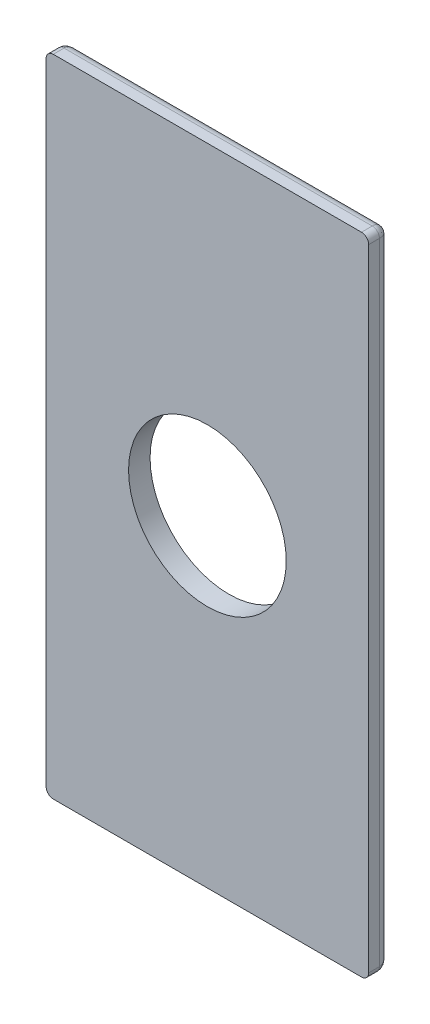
ISO-10303-21;
HEADER;
FILE_DESCRIPTION(('STEP AP214'),'2;1');
FILE_NAME('part.step','',(''),(''),'','','');
FILE_SCHEMA(('AUTOMOTIVE_DESIGN { 1 0 10303 214 1 1 1 1 }'));
ENDSEC;
DATA;
#1=APPLICATION_CONTEXT('core data for automotive mechanical design processes');
#2=APPLICATION_PROTOCOL_DEFINITION('international standard','automotive_design',2000,#1);
#3=PRODUCT_CONTEXT('',#1,'mechanical');
#4=PRODUCT('Part','Part','',(#3));
#5=PRODUCT_RELATED_PRODUCT_CATEGORY('part','',(#4));
#6=PRODUCT_DEFINITION_FORMATION('','',#4);
#7=PRODUCT_DEFINITION_CONTEXT('part definition',#1,'design');
#8=PRODUCT_DEFINITION('design','',#6,#7);
#9=PRODUCT_DEFINITION_SHAPE('','',#8);
#10=(LENGTH_UNIT() NAMED_UNIT(*) SI_UNIT(.MILLI.,.METRE.));
#11=(NAMED_UNIT(*) PLANE_ANGLE_UNIT() SI_UNIT($,.RADIAN.));
#12=(NAMED_UNIT(*) SI_UNIT($,.STERADIAN.) SOLID_ANGLE_UNIT());
#13=UNCERTAINTY_MEASURE_WITH_UNIT(LENGTH_MEASURE(1.E-05),#10,'distance_accuracy_value','');
#14=(GEOMETRIC_REPRESENTATION_CONTEXT(3) GLOBAL_UNCERTAINTY_ASSIGNED_CONTEXT((#13)) GLOBAL_UNIT_ASSIGNED_CONTEXT((#10,
#11,#12)) REPRESENTATION_CONTEXT('',''));
#15=CARTESIAN_POINT('',(0.,0.,0.));
#16=DIRECTION('',(0.,0.,1.));
#17=DIRECTION('',(1.,0.,0.));
#18=AXIS2_PLACEMENT_3D('',#15,#16,#17);
#19=CARTESIAN_POINT('',(21.5,-45.,1.5));
#20=CARTESIAN_POINT('',(21.6495996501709,-45.,1.5));
#21=CARTESIAN_POINT('',(21.8738186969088,-44.9486387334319,1.5));
#22=CARTESIAN_POINT('',(22.1286999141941,-44.7883214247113,1.5));
#23=CARTESIAN_POINT('',(22.3150622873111,-44.602148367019,1.5));
#24=CARTESIAN_POINT('',(22.4618750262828,-44.3365622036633,1.5));
#25=CARTESIAN_POINT('',(22.5,-44.1121997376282,1.5));
#26=CARTESIAN_POINT('',(22.5,-44.,1.5));
#27=CARTESIAN_POINT('',(21.5,-45.,1.38780026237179));
#28=CARTESIAN_POINT('',(21.6495996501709,-45.,1.3765841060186));
#29=CARTESIAN_POINT('',(21.8738186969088,-44.9486387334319,1.36367785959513));
#30=CARTESIAN_POINT('',(22.1286999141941,-44.7883214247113,1.35659921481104));
#31=CARTESIAN_POINT('',(22.3150622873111,-44.602148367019,1.3565890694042));
#32=CARTESIAN_POINT('',(22.4618750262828,-44.3365622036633,1.36547389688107));
#33=CARTESIAN_POINT('',(22.5,-44.1121997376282,1.37940644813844));
#34=CARTESIAN_POINT('',(22.5,-44.,1.38780026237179));
#35=CARTESIAN_POINT('',(21.4915873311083,-44.9747619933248,1.16338370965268));
#36=CARTESIAN_POINT('',(21.6351543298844,-44.969287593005,1.12990052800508));
#37=CARTESIAN_POINT('',(21.8503425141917,-44.9129510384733,1.09140205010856));
#38=CARTESIAN_POINT('',(22.0969939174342,-44.7530973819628,1.07030167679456));
#39=CARTESIAN_POINT('',(22.2792299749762,-44.5710223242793,1.0702707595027));
#40=CARTESIAN_POINT('',(22.4266897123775,-44.3145760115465,1.09675512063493));
#41=CARTESIAN_POINT('',(22.4706410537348,-44.0992592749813,1.13831989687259));
#42=CARTESIAN_POINT('',(22.4747619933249,-43.9915873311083,1.16338370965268));
#43=CARTESIAN_POINT('',(21.4542722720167,-44.8628168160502,0.843752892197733));
#44=CARTESIAN_POINT('',(21.5757425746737,-44.8396615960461,0.79317328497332));
#45=CARTESIAN_POINT('',(21.7578957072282,-44.7691086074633,0.735820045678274));
#46=CARTESIAN_POINT('',(21.9731092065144,-44.6144834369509,0.704552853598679));
#47=CARTESIAN_POINT('',(22.138128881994,-44.4495697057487,0.704515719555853));
#48=CARTESIAN_POINT('',(22.2840790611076,-44.2275872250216,0.743730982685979));
#49=CARTESIAN_POINT('',(22.3454981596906,-44.0453899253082,0.8058786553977));
#50=CARTESIAN_POINT('',(22.3628168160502,-43.9542722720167,0.843752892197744));
#51=CARTESIAN_POINT('',(21.3742564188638,-44.6227692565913,0.46114030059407));
#52=CARTESIAN_POINT('',(21.4596880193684,-44.5786691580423,0.413716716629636));
#53=CARTESIAN_POINT('',(21.5878722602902,-44.4960532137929,0.361354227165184));
#54=CARTESIAN_POINT('',(21.7480550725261,-44.3602424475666,0.333106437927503));
#55=CARTESIAN_POINT('',(21.8789785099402,-44.2293577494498,0.3330875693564));
#56=CARTESIAN_POINT('',(22.0112784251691,-44.0665124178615,0.368462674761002));
#57=CARTESIAN_POINT('',(22.089778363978,-43.9383537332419,0.425600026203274));
#58=CARTESIAN_POINT('',(22.1227692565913,-43.8742564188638,0.46114030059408));
#59=CARTESIAN_POINT('',(21.224383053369,-44.1731491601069,0.102456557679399));
#60=CARTESIAN_POINT('',(21.2669279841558,-44.1301646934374,0.088221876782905));
#61=CARTESIAN_POINT('',(21.3307833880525,-44.0658665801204,0.073209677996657));
#62=CARTESIAN_POINT('',(21.4161010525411,-43.9801943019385,0.065260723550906));
#63=CARTESIAN_POINT('',(21.4908951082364,-43.9054155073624,0.065262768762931));
#64=CARTESIAN_POINT('',(21.5765989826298,-43.8201368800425,0.075189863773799));
#65=CARTESIAN_POINT('',(21.6409777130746,-43.7563091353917,0.091771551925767));
#66=CARTESIAN_POINT('',(21.6731491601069,-43.724383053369,0.102456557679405));
#67=CARTESIAN_POINT('',(21.0747998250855,-43.7243994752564,0.));
#68=CARTESIAN_POINT('',(21.089047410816,-43.7101518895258,0.));
#69=CARTESIAN_POINT('',(21.1104187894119,-43.68878051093,0.));
#70=CARTESIAN_POINT('',(21.138913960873,-43.6602853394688,0.));
#71=CARTESIAN_POINT('',(21.1638472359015,-43.6353520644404,0.));
#72=CARTESIAN_POINT('',(21.1923424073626,-43.6068568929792,0.));
#73=CARTESIAN_POINT('',(21.2137137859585,-43.5854855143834,0.));
#74=CARTESIAN_POINT('',(21.2243994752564,-43.5747998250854,0.));
#75=CARTESIAN_POINT('',(21.,-43.5,0.));
#76=CARTESIAN_POINT('',(21.,-43.5,0.));
#77=CARTESIAN_POINT('',(21.,-43.5,0.));
#78=CARTESIAN_POINT('',(21.,-43.5,0.));
#79=CARTESIAN_POINT('',(21.,-43.5,0.));
#80=CARTESIAN_POINT('',(21.,-43.5,0.));
#81=CARTESIAN_POINT('',(21.,-43.5,0.));
#82=CARTESIAN_POINT('',(21.,-43.5,0.));
#83=B_SPLINE_SURFACE_WITH_KNOTS('',3,3,((#19,#20,#21,#22,#23,#24,#25,#26),(#27,#28,#29,#30,#31,
#32,#33,#34),(#35,#36,#37,#38,#39,#40,#41,#42),(#43,#44,#45,#46,#47,#48,#49,#50),(#51,#52,#53,
#54,#55,#56,#57,#58),(#59,#60,#61,#62,#63,#64,#65,#66),(#67,#68,#69,#70,#71,#72,#73,#74),(#75,
#76,#77,#78,#79,#80,#81,#82)),.UNSPECIFIED.,.F.,.F.,.F.,(4,1,1,1,1,4),(4,1,1,1,1,4),(0.,
0.224399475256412,0.448798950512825,0.673198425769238,1.12199737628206,1.57079632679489),(0.,
0.285714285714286,0.428571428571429,0.571428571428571,0.785714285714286,1.),.UNSPECIFIED.);
#84=CARTESIAN_POINT('',(21.,-43.5,0.));
#85=CARTESIAN_POINT('',(21.2243994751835,-43.5747998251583,0.));
#86=CARTESIAN_POINT('',(21.6731491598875,-43.7243830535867,0.102456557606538));
#87=CARTESIAN_POINT('',(22.1227692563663,-43.8742564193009,0.461140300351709));
#88=CARTESIAN_POINT('',(22.3628168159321,-43.9542722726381,0.843752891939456));
#89=CARTESIAN_POINT('',(22.4747619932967,-43.9915873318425,1.16338370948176));
#90=CARTESIAN_POINT('',(22.5,-44.0000000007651,1.38780026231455));
#91=CARTESIAN_POINT('',(22.5,-44.0000000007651,1.5));
#92=B_SPLINE_CURVE_WITH_KNOTS('',3,(#84,#85,#86,#87,#88,#89,#90,#91),.UNSPECIFIED.,.F.,.F.,(4,1,
1,1,1,4),(0.,0.448798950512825,0.89759790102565,1.12199737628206,1.34639685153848,
1.57079632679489),.UNSPECIFIED.);
#93=CARTESIAN_POINT('',(22.5,-44.0000000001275,1.5));
#94=VERTEX_POINT('',#93);
#95=CARTESIAN_POINT('',(21.,-43.5,0.));
#96=VERTEX_POINT('',#95);
#97=EDGE_CURVE('E114',#94,#96,#92,.F.);
#98=CARTESIAN_POINT('',(22.5,-44.,1.5));
#99=CARTESIAN_POINT('',(22.5000000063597,-44.0130898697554,1.5));
#100=CARTESIAN_POINT('',(22.4997405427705,-44.0261796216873,1.5));
#101=CARTESIAN_POINT('',(22.4987060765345,-44.0523386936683,1.5));
#102=CARTESIAN_POINT('',(22.4979310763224,-44.0654080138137,1.5));
#103=CARTESIAN_POINT('',(22.4958689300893,-44.0915062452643,1.5));
#104=CARTESIAN_POINT('',(22.4945817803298,-44.1045351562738,1.5));
#105=CARTESIAN_POINT('',(22.4914987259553,-44.1305326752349,1.5));
#106=CARTESIAN_POINT('',(22.4897028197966,-44.1435012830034,1.5));
#107=CARTESIAN_POINT('',(22.4856056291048,-44.1693582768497,1.5));
#108=CARTESIAN_POINT('',(22.48330434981,-44.1822466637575,1.5));
#109=CARTESIAN_POINT('',(22.4781997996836,-44.2079233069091,1.5));
#110=CARTESIAN_POINT('',(22.475396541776,-44.220711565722,1.5));
#111=CARTESIAN_POINT('',(22.4692913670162,-44.2461680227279,1.5));
#112=CARTESIAN_POINT('',(22.4659894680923,-44.2588362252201,1.5));
#113=CARTESIAN_POINT('',(22.4588905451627,-44.2840327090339,1.5));
#114=CARTESIAN_POINT('',(22.4550935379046,-44.2965609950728,1.5));
#115=CARTESIAN_POINT('',(22.447007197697,-44.3214575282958,1.5));
#116=CARTESIAN_POINT('',(22.4427178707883,-44.3338257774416,1.5));
#117=CARTESIAN_POINT('',(22.4336530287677,-44.3583831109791,1.5));
#118=CARTESIAN_POINT('',(22.4288775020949,-44.3705721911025,1.5));
#119=CARTESIAN_POINT('',(22.4188508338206,-44.3947536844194,1.5));
#120=CARTESIAN_POINT('',(22.4135996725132,-44.4067460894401,1.5));
#121=CARTESIAN_POINT('',(22.4026314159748,-44.4305164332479,1.5));
#122=CARTESIAN_POINT('',(22.3969143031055,-44.4422943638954,1.5));
#123=CARTESIAN_POINT('',(22.3850240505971,-44.4656180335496,1.5));
#124=CARTESIAN_POINT('',(22.3788509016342,-44.4771637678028,1.5));
#125=CARTESIAN_POINT('',(22.3660584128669,-44.5000052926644,1.5));
#126=CARTESIAN_POINT('',(22.3594390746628,-44.5113010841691,1.5));
#127=CARTESIAN_POINT('',(22.3457640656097,-44.5336249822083,1.5));
#128=CARTESIAN_POINT('',(22.338708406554,-44.5446530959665,1.5));
#129=CARTESIAN_POINT('',(22.3241705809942,-44.5664238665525,1.5));
#130=CARTESIAN_POINT('',(22.3166884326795,-44.5771665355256,1.5));
#131=CARTESIAN_POINT('',(22.3013075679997,-44.5983487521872,1.5));
#132=CARTESIAN_POINT('',(22.2934088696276,-44.6087883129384,1.5));
#133=CARTESIAN_POINT('',(22.277204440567,-44.6293462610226,1.5));
#134=CARTESIAN_POINT('',(22.2688987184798,-44.639464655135,1.5));
#135=CARTESIAN_POINT('',(22.2518945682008,-44.6593660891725,1.5));
#136=CARTESIAN_POINT('',(22.2431961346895,-44.6691491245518,1.5));
#137=CARTESIAN_POINT('',(22.2254214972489,-44.6883663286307,1.5));
#138=CARTESIAN_POINT('',(22.2163452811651,-44.6978004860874,1.5));
#139=CARTESIAN_POINT('',(22.1978298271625,-44.7163062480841,1.5));
#140=CARTESIAN_POINT('',(22.1883905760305,-44.7253778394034,1.5));
#141=CARTESIAN_POINT('',(22.169163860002,-44.7431448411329,1.5));
#142=CARTESIAN_POINT('',(22.1593763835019,-44.751840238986,1.5));
#143=CARTESIAN_POINT('',(22.1394679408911,-44.7688411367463,1.5));
#144=CARTESIAN_POINT('',(22.1293469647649,-44.7771466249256,1.5));
#145=CARTESIAN_POINT('',(22.1087865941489,-44.7933542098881,1.5));
#146=CARTESIAN_POINT('',(22.098347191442,-44.8012562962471,1.5));
#147=CARTESIAN_POINT('',(22.0771668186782,-44.8166454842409,1.5));
#148=CARTESIAN_POINT('',(22.0664258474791,-44.8241325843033,1.5));
#149=CARTESIAN_POINT('',(22.044659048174,-44.8386800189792,1.5));
#150=CARTESIAN_POINT('',(22.0336332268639,-44.8457403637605,1.5));
#151=CARTESIAN_POINT('',(22.0113134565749,-44.8594224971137,1.5));
#152=CARTESIAN_POINT('',(22.0000195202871,-44.8660443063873,1.5));
#153=CARTESIAN_POINT('',(21.9771803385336,-44.8788377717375,1.5));
#154=CARTESIAN_POINT('',(21.9656351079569,-44.8850094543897,1.5));
#155=CARTESIAN_POINT('',(21.9423097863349,-44.8968903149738,1.5));
#156=CARTESIAN_POINT('',(21.9305297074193,-44.9025995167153,1.5));
#157=CARTESIAN_POINT('',(21.9067527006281,-44.9135464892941,1.5));
#158=CARTESIAN_POINT('',(21.8947557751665,-44.9187842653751,1.5));
#159=CARTESIAN_POINT('',(21.8705649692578,-44.9287842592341,1.5));
#160=CARTESIAN_POINT('',(21.8583710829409,-44.9335464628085,1.5));
#161=CARTESIAN_POINT('',(21.8338057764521,-44.9425902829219,1.5));
#162=CARTESIAN_POINT('',(21.8214343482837,-44.9468718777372,1.5));
#163=CARTESIAN_POINT('',(21.7965334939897,-44.9549496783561,1.5));
#164=CARTESIAN_POINT('',(21.7840040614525,-44.9587458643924,1.5));
#165=CARTESIAN_POINT('',(21.7588066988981,-44.9658479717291,1.5));
#166=CARTESIAN_POINT('',(21.7461387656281,-44.9691538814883,1.5));
#167=CARTESIAN_POINT('',(21.7206839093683,-44.9752705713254,1.5));
#168=CARTESIAN_POINT('',(21.707896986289,-44.9780813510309,1.5));
#169=CARTESIAN_POINT('',(21.6822236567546,-44.9832029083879,1.5));
#170=CARTESIAN_POINT('',(21.6693372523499,-44.9855136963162,1.5));
#171=CARTESIAN_POINT('',(21.6434844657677,-44.9896303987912,1.5));
#172=CARTESIAN_POINT('',(21.6305180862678,-44.9914363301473,1.5));
#173=CARTESIAN_POINT('',(21.6045248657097,-44.9945384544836,1.5));
#174=CARTESIAN_POINT('',(21.5914980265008,-44.995834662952,1.5));
#175=CARTESIAN_POINT('',(21.565403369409,-44.997912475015,1.5));
#176=CARTESIAN_POINT('',(21.5523355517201,-44.9986940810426,1.5));
#177=CARTESIAN_POINT('',(21.526178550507,-44.9997378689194,1.5));
#178=CARTESIAN_POINT('',(21.5130893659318,-45.000000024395,1.5));
#179=CARTESIAN_POINT('',(21.5,-45.,1.5));
#180=B_SPLINE_CURVE_WITH_KNOTS('',3,(#98,#99,#100,#101,#102,#103,#104,#105,#106,#107,#108,#109,
#110,#111,#112,#113,#114,#115,#116,#117,#118,#119,#120,#121,#122,#123,#124,#125,#126,#127,#128,
#129,#130,#131,#132,#133,#134,#135,#136,#137,#138,#139,#140,#141,#142,#143,#144,#145,#146,#147,
#148,#149,#150,#151,#152,#153,#154,#155,#156,#157,#158,#159,#160,#161,#162,#163,#164,#165,#166,
#167,#168,#169,#170,#171,#172,#173,#174,#175,#176,#177,#178,#179),.UNSPECIFIED.,.F.,.F.,(4,2,2,
2,2,2,2,2,2,2,2,2,2,2,2,2,2,2,2,2,2,2,2,2,2,2,2,2,2,2,2,2,2,2,2,2,2,2,2,2,4),(0.,
0.0392668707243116,0.0785335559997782,0.11780052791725,0.157067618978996,0.196334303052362,
0.235599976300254,0.27486423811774,0.314127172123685,0.353389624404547,0.392653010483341,
0.43191802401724,0.471184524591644,0.510451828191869,0.549718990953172,0.588985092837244,
0.628249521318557,0.667512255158,0.706774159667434,0.74603659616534,0.785300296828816,
0.824565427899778,0.86383186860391,0.903099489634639,0.942368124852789,0.981636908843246,
1.02090475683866,1.06017074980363,1.09943442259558,1.13869607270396,1.17795728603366,
1.21721967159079,1.25648383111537,1.29574958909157,1.33501627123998,1.37428298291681,
1.4135488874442,1.45281348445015,1.49207688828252,1.53134010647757,1.57060531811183),.UNSPECIFIED.);
#181=CARTESIAN_POINT('',(21.5,-45.,1.5));
#182=VERTEX_POINT('',#181);
#183=EDGE_CURVE('E97',#94,#182,#180,.T.);
#184=CARTESIAN_POINT('',(21.5,-45.,1.5));
#185=CARTESIAN_POINT('',(21.5000000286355,-45.0000000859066,1.48036418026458));
#186=CARTESIAN_POINT('',(21.499871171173,-44.9996135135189,1.46072847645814));
#187=CARTESIAN_POINT('',(21.4993568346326,-44.9980705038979,1.42148698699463));
#188=CARTESIAN_POINT('',(21.4989713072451,-44.9969139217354,1.40188120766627));
#189=CARTESIAN_POINT('',(21.4979446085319,-44.9938338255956,1.36273004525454));
#190=CARTESIAN_POINT('',(21.497303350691,-44.9919100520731,1.34318468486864));
#191=CARTESIAN_POINT('',(21.4957661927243,-44.9872985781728,1.30418475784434));
#192=CARTESIAN_POINT('',(21.4948701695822,-44.9846105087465,1.28473023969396));
#193=CARTESIAN_POINT('',(21.4928245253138,-44.9784735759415,1.24594237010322));
#194=CARTESIAN_POINT('',(21.4916747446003,-44.9750242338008,1.22660910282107));
#195=CARTESIAN_POINT('',(21.4891224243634,-44.9673672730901,1.18809423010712));
#196=CARTESIAN_POINT('',(21.4877196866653,-44.963159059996,1.16891275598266));
#197=CARTESIAN_POINT('',(21.4846631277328,-44.9539893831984,1.13073133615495));
#198=CARTESIAN_POINT('',(21.4830090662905,-44.9490271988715,1.11173158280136));
#199=CARTESIAN_POINT('',(21.4794537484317,-44.9383612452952,1.07394138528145));
#200=CARTESIAN_POINT('',(21.4775522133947,-44.9326566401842,1.05515120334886));
#201=CARTESIAN_POINT('',(21.4735054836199,-44.9205164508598,1.01780810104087));
#202=CARTESIAN_POINT('',(21.4713599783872,-44.9140799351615,0.99925551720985));
#203=CARTESIAN_POINT('',(21.46682891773,-44.9004867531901,0.962415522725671));
#204=CARTESIAN_POINT('',(21.4644430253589,-44.8933290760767,0.944128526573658));
#205=CARTESIAN_POINT('',(21.459434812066,-44.878304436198,0.907847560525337));
#206=CARTESIAN_POINT('',(21.4568121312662,-44.8704363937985,0.889854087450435));
#207=CARTESIAN_POINT('',(21.4513338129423,-44.854001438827,0.85418830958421));
#208=CARTESIAN_POINT('',(21.4484777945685,-44.8454333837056,0.836516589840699));
#209=CARTESIAN_POINT('',(21.4425371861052,-44.8276115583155,0.801521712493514));
#210=CARTESIAN_POINT('',(21.4394522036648,-44.8183566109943,0.784199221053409));
#211=CARTESIAN_POINT('',(21.4330586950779,-44.7991760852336,0.74992960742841));
#212=CARTESIAN_POINT('',(21.429749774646,-44.7892493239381,0.732983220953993));
#213=CARTESIAN_POINT('',(21.4229132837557,-44.768739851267,0.699492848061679));
#214=CARTESIAN_POINT('',(21.4193853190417,-44.7581559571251,0.682949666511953));
#215=CARTESIAN_POINT('',(21.4121156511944,-44.736346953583,0.65029273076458));
#216=CARTESIAN_POINT('',(21.408373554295,-44.725120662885,0.634179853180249));
#217=CARTESIAN_POINT('',(21.400680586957,-44.7020417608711,0.602410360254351));
#218=CARTESIAN_POINT('',(21.3967293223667,-44.6901879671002,0.586754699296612));
#219=CARTESIAN_POINT('',(21.388622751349,-44.665868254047,0.555927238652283));
#220=CARTESIAN_POINT('',(21.3844670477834,-44.6534011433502,0.540756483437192));
#221=CARTESIAN_POINT('',(21.3759591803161,-44.6278775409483,0.510918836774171));
#222=CARTESIAN_POINT('',(21.3716066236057,-44.6148198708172,0.496253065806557));
#223=CARTESIAN_POINT('',(21.3627129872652,-44.5881389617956,0.467444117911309));
#224=CARTESIAN_POINT('',(21.3581715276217,-44.574514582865,0.453302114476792));
#225=CARTESIAN_POINT('',(21.3489079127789,-44.5467237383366,0.425559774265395));
#226=CARTESIAN_POINT('',(21.3441853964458,-44.5325561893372,0.41196064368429));
#227=CARTESIAN_POINT('',(21.3345675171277,-44.5037025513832,0.385323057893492));
#228=CARTESIAN_POINT('',(21.3296718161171,-44.4890154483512,0.372285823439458));
#229=CARTESIAN_POINT('',(21.3197154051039,-44.4591462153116,0.34679108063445));
#230=CARTESIAN_POINT('',(21.3146543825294,-44.4439631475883,0.334334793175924));
#231=CARTESIAN_POINT('',(21.3043751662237,-44.4131254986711,0.310021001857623));
#232=CARTESIAN_POINT('',(21.2991566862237,-44.3974700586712,0.298164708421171));
#233=CARTESIAN_POINT('',(21.2885703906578,-44.3657111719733,0.275069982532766));
#234=CARTESIAN_POINT('',(21.2832023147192,-44.3496069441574,0.263832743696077));
#235=CARTESIAN_POINT('',(21.2723246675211,-44.3169740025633,0.241995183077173));
#236=CARTESIAN_POINT('',(21.2668148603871,-44.3004445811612,0.231396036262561));
#237=CARTESIAN_POINT('',(21.2556615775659,-44.2669847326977,0.210853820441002));
#238=CARTESIAN_POINT('',(21.2500178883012,-44.2500536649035,0.200911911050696));
#239=CARTESIAN_POINT('',(21.2386047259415,-44.2158141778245,0.181702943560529));
#240=CARTESIAN_POINT('',(21.2328350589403,-44.198505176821,0.172437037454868));
#241=CARTESIAN_POINT('',(21.2211776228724,-44.1635328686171,0.154600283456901));
#242=CARTESIAN_POINT('',(21.2152896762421,-44.1458690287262,0.146030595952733));
#243=CARTESIAN_POINT('',(21.2034044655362,-44.1102133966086,0.129600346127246));
#244=CARTESIAN_POINT('',(21.1974070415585,-44.0922211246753,0.121740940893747));
#245=CARTESIAN_POINT('',(21.1853129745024,-44.0559389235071,0.106736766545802));
#246=CARTESIAN_POINT('',(21.1792161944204,-44.0376485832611,0.0995931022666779));
#247=CARTESIAN_POINT('',(21.1669332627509,-44.0007997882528,0.0860276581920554));
#248=CARTESIAN_POINT('',(21.1607469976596,-43.9822409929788,0.0796069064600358));
#249=CARTESIAN_POINT('',(21.1482950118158,-43.9448850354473,0.0674941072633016));
#250=CARTESIAN_POINT('',(21.1420292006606,-43.9260876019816,0.0618029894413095));
#251=CARTESIAN_POINT('',(21.1294280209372,-43.8882840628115,0.0511564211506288));
#252=CARTESIAN_POINT('',(21.1230925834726,-43.8692777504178,0.0462017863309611));
#253=CARTESIAN_POINT('',(21.1103620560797,-43.8310861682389,0.0370351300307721));
#254=CARTESIAN_POINT('',(21.1039669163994,-43.8119007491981,0.0328237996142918));
#255=CARTESIAN_POINT('',(21.0911268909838,-43.7733806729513,0.025150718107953));
#256=CARTESIAN_POINT('',(21.0846819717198,-43.7540459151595,0.0216895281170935));
#257=CARTESIAN_POINT('',(21.0717522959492,-43.7152568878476,0.0155236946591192));
#258=CARTESIAN_POINT('',(21.06526751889,-43.6958025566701,0.0128194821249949));
#259=CARTESIAN_POINT('',(21.0522680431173,-43.6568041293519,0.00817457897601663));
#260=CARTESIAN_POINT('',(21.0457533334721,-43.6372600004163,0.00623419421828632));
#261=CARTESIAN_POINT('',(21.032703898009,-43.598111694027,0.00312388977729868));
#262=CARTESIAN_POINT('',(21.0261691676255,-43.5785075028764,0.00195416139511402));
#263=CARTESIAN_POINT('',(21.0130896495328,-43.5392689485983,0.000392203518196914));
#264=CARTESIAN_POINT('',(21.0065448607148,-43.5196345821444,6.69760596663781E-08));
#265=CARTESIAN_POINT('',(21.,-43.5,0.));
#266=B_SPLINE_CURVE_WITH_KNOTS('',3,(#184,#185,#186,#187,#188,#189,#190,#191,#192,#193,#194,
#195,#196,#197,#198,#199,#200,#201,#202,#203,#204,#205,#206,#207,#208,#209,#210,#211,#212,#213,
#214,#215,#216,#217,#218,#219,#220,#221,#222,#223,#224,#225,#226,#227,#228,#229,#230,#231,#232,
#233,#234,#235,#236,#237,#238,#239,#240,#241,#242,#243,#244,#245,#246,#247,#248,#249,#250,#251,
#252,#253,#254,#255,#256,#257,#258,#259,#260,#261,#262,#263,#264,#265),.UNSPECIFIED.,.F.,.F.,(4,
2,2,2,2,2,2,2,2,2,2,2,2,2,2,2,2,2,2,2,2,2,2,2,2,2,2,2,2,2,2,2,2,2,2,2,2,2,2,2,4),(0.,
0.0589030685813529,0.117817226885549,0.176751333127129,0.235713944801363,0.294713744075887,
0.353759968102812,0.41286298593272,0.472033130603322,0.531279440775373,0.590609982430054,
0.650032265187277,0.709553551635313,0.769179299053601,0.828912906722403,0.888757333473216,
0.948715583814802,1.00879114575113,1.06898841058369,1.12931160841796,1.18976265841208,
1.25034129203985,1.31104550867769,1.37187202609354,1.43281672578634,1.49387509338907,
1.55504265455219,1.61631540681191,1.67769024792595,1.73916536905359,1.80073889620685,
1.86240605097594,1.92415982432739,1.9859915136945,2.04789117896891,2.10984809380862,
2.17185119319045,2.23388951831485,2.29595266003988,2.35803120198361,2.42011716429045),.UNSPECIFIED.);
#267=EDGE_CURVE('E118',#96,#182,#266,.F.);
#268=ORIENTED_EDGE('',*,*,#97,.F.);
#269=ORIENTED_EDGE('',*,*,#183,.T.);
#270=ORIENTED_EDGE('',*,*,#267,.F.);
#271=EDGE_LOOP('',(#268,#269,#270));
#272=FACE_BOUND('',#271,.T.);
#273=ADVANCED_FACE('F16',(#272),#83,.T.);
#274=CARTESIAN_POINT('',(22.5,44.,1.5));
#275=CARTESIAN_POINT('',(22.5,44.1495996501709,1.5));
#276=CARTESIAN_POINT('',(22.4486387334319,44.3738186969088,1.5));
#277=CARTESIAN_POINT('',(22.2883214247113,44.6286999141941,1.5));
#278=CARTESIAN_POINT('',(22.102148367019,44.8150622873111,1.5));
#279=CARTESIAN_POINT('',(21.8365622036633,44.9618750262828,1.5));
#280=CARTESIAN_POINT('',(21.6121997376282,45.,1.5));
#281=CARTESIAN_POINT('',(21.5,45.,1.5));
#282=CARTESIAN_POINT('',(22.5,44.,1.38780026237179));
#283=CARTESIAN_POINT('',(22.5,44.1495996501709,1.3765841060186));
#284=CARTESIAN_POINT('',(22.4486387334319,44.3738186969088,1.36367785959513));
#285=CARTESIAN_POINT('',(22.2883214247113,44.6286999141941,1.35659921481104));
#286=CARTESIAN_POINT('',(22.102148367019,44.8150622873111,1.3565890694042));
#287=CARTESIAN_POINT('',(21.8365622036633,44.9618750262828,1.36547389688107));
#288=CARTESIAN_POINT('',(21.6121997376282,45.,1.37940644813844));
#289=CARTESIAN_POINT('',(21.5,45.,1.38780026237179));
#290=CARTESIAN_POINT('',(22.4745884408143,43.9915294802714,1.1635417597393));
#291=CARTESIAN_POINT('',(22.469436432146,44.1352787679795,1.13007533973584));
#292=CARTESIAN_POINT('',(22.413444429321,44.350740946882,1.09154224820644));
#293=CARTESIAN_POINT('',(22.2537301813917,44.59759262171,1.07041027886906));
#294=CARTESIAN_POINT('',(22.0716155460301,44.7798699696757,1.07037891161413));
#295=CARTESIAN_POINT('',(21.8149292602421,44.9271409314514,1.09690475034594));
#296=CARTESIAN_POINT('',(21.5993388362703,44.9707115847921,1.13849238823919));
#297=CARTESIAN_POINT('',(21.4915294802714,44.9745884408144,1.16354175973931));
#298=CARTESIAN_POINT('',(22.325760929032,43.9419203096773,0.736971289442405));
#299=CARTESIAN_POINT('',(22.2962171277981,44.0557419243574,0.680636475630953));
#300=CARTESIAN_POINT('',(22.2204044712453,44.2264611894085,0.617015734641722));
#301=CARTESIAN_POINT('',(22.0673021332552,44.4308888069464,0.582385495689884));
#302=CARTESIAN_POINT('',(21.9081680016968,44.5901092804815,0.582347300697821));
#303=CARTESIAN_POINT('',(21.6980413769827,44.7358510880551,0.625770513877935));
#304=CARTESIAN_POINT('',(21.5273079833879,44.8036736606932,0.694783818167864));
#305=CARTESIAN_POINT('',(21.4419203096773,44.825760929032,0.736971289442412));
#306=CARTESIAN_POINT('',(22.0388414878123,43.8462804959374,0.377489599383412));
#307=CARTESIAN_POINT('',(21.9924894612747,43.922364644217,0.337545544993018));
#308=CARTESIAN_POINT('',(21.9109702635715,44.0365183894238,0.293818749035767));
#309=CARTESIAN_POINT('',(21.7838343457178,44.1810841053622,0.2703078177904));
#310=CARTESIAN_POINT('',(21.663958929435,44.3009851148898,0.270296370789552));
#311=CARTESIAN_POINT('',(21.5174948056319,44.4256109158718,0.299724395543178));
#312=CARTESIAN_POINT('',(21.4033603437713,44.504138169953,0.347547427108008));
#313=CARTESIAN_POINT('',(21.3462804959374,44.5388414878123,0.377489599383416));
#314=CARTESIAN_POINT('',(21.5605808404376,43.6868602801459,0.077179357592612));
#315=CARTESIAN_POINT('',(21.5254487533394,43.7226859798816,0.066454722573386));
#316=CARTESIAN_POINT('',(21.4725798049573,43.7764578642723,0.055007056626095));
#317=CARTESIAN_POINT('',(21.401462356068,43.8479729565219,0.048915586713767));
#318=CARTESIAN_POINT('',(21.3390555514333,43.9103956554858,0.048915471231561));
#319=CARTESIAN_POINT('',(21.267493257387,43.9814383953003,0.056528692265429));
#320=CARTESIAN_POINT('',(21.2137454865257,44.0342921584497,0.069131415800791));
#321=CARTESIAN_POINT('',(21.1868602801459,44.0605808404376,0.077179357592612));
#322=CARTESIAN_POINT('',(21.2243994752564,43.5747998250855,0.));
#323=CARTESIAN_POINT('',(21.2101518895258,43.589047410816,0.));
#324=CARTESIAN_POINT('',(21.18878051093,43.6104187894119,0.));
#325=CARTESIAN_POINT('',(21.1602853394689,43.638913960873,0.));
#326=CARTESIAN_POINT('',(21.1353520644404,43.6638472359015,0.));
#327=CARTESIAN_POINT('',(21.1068568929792,43.6923424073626,0.));
#328=CARTESIAN_POINT('',(21.0854855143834,43.7137137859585,0.));
#329=CARTESIAN_POINT('',(21.0747998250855,43.7243994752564,0.));
#330=CARTESIAN_POINT('',(21.,43.5,0.));
#331=CARTESIAN_POINT('',(21.,43.5,0.));
#332=CARTESIAN_POINT('',(21.,43.5,0.));
#333=CARTESIAN_POINT('',(21.,43.5,0.));
#334=CARTESIAN_POINT('',(21.,43.5,0.));
#335=CARTESIAN_POINT('',(21.,43.5,0.));
#336=CARTESIAN_POINT('',(21.,43.5,0.));
#337=CARTESIAN_POINT('',(21.,43.5,0.));
#338=B_SPLINE_SURFACE_WITH_KNOTS('',3,3,((#274,#275,#276,#277,#278,#279,#280,#281),(#282,#283,
#284,#285,#286,#287,#288,#289),(#290,#291,#292,#293,#294,#295,#296,#297),(#298,#299,#300,#301,
#302,#303,#304,#305),(#306,#307,#308,#309,#310,#311,#312,#313),(#314,#315,#316,#317,#318,#319,
#320,#321),(#322,#323,#324,#325,#326,#327,#328,#329),(#330,#331,#332,#333,#334,#335,#336,#337)),
.UNSPECIFIED.,.F.,.F.,.F.,(4,1,1,1,1,4),(4,1,1,1,1,4),(0.,0.224399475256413,0.448798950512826,
0.897597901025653,1.12199737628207,1.57079632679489),(0.,0.285714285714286,0.428571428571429,
0.571428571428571,0.785714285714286,1.),.UNSPECIFIED.);
#339=CARTESIAN_POINT('',(21.,43.5,0.));
#340=CARTESIAN_POINT('',(21.0747998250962,43.7243994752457,0.));
#341=CARTESIAN_POINT('',(21.1868602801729,44.0605808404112,0.0771793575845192));
#342=CARTESIAN_POINT('',(21.3462804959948,44.5388414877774,0.377489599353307));
#343=CARTESIAN_POINT('',(21.4419203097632,44.8257609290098,0.73697128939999));
#344=CARTESIAN_POINT('',(21.4915294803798,44.9745884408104,1.16354175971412));
#345=CARTESIAN_POINT('',(21.5000000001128,45.,1.38780026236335));
#346=CARTESIAN_POINT('',(21.5000000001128,45.,1.5));
#347=B_SPLINE_CURVE_WITH_KNOTS('',3,(#339,#340,#341,#342,#343,#344,#345,#346),.UNSPECIFIED.,.F.,
.F.,(4,1,1,1,1,4),(0.,0.448798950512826,0.673198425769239,1.12199737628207,1.34639685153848,
1.57079632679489),.UNSPECIFIED.);
#348=CARTESIAN_POINT('',(21.5000000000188,45.,1.5));
#349=VERTEX_POINT('',#348);
#350=CARTESIAN_POINT('',(21.,43.5,0.));
#351=VERTEX_POINT('',#350);
#352=EDGE_CURVE('E226',#349,#351,#347,.F.);
#353=CARTESIAN_POINT('',(21.5,45.,1.5));
#354=CARTESIAN_POINT('',(21.5130898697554,45.0000000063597,1.5));
#355=CARTESIAN_POINT('',(21.5261796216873,44.9997405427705,1.5));
#356=CARTESIAN_POINT('',(21.5523386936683,44.9987060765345,1.5));
#357=CARTESIAN_POINT('',(21.5654080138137,44.9979310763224,1.5));
#358=CARTESIAN_POINT('',(21.5915062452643,44.9958689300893,1.5));
#359=CARTESIAN_POINT('',(21.6045351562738,44.9945817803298,1.5));
#360=CARTESIAN_POINT('',(21.6305326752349,44.9914987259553,1.5));
#361=CARTESIAN_POINT('',(21.6435012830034,44.9897028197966,1.5));
#362=CARTESIAN_POINT('',(21.6693582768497,44.9856056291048,1.5));
#363=CARTESIAN_POINT('',(21.6822466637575,44.98330434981,1.5));
#364=CARTESIAN_POINT('',(21.7079233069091,44.9781997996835,1.5));
#365=CARTESIAN_POINT('',(21.720711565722,44.975396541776,1.5));
#366=CARTESIAN_POINT('',(21.7461680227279,44.9692913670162,1.5));
#367=CARTESIAN_POINT('',(21.7588362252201,44.9659894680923,1.5));
#368=CARTESIAN_POINT('',(21.7840327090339,44.9588905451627,1.5));
#369=CARTESIAN_POINT('',(21.7965609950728,44.9550935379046,1.5));
#370=CARTESIAN_POINT('',(21.8214575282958,44.947007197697,1.5));
#371=CARTESIAN_POINT('',(21.8338257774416,44.9427178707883,1.5));
#372=CARTESIAN_POINT('',(21.858383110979,44.9336530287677,1.5));
#373=CARTESIAN_POINT('',(21.8705721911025,44.9288775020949,1.5));
#374=CARTESIAN_POINT('',(21.8947536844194,44.9188508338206,1.5));
#375=CARTESIAN_POINT('',(21.9067460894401,44.9135996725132,1.5));
#376=CARTESIAN_POINT('',(21.9305164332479,44.9026314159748,1.5));
#377=CARTESIAN_POINT('',(21.9422943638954,44.8969143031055,1.5));
#378=CARTESIAN_POINT('',(21.9656180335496,44.885024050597,1.5));
#379=CARTESIAN_POINT('',(21.9771637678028,44.8788509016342,1.5));
#380=CARTESIAN_POINT('',(22.0000052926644,44.8660584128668,1.5));
#381=CARTESIAN_POINT('',(22.0113010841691,44.8594390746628,1.5));
#382=CARTESIAN_POINT('',(22.0336249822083,44.8457640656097,1.5));
#383=CARTESIAN_POINT('',(22.0446530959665,44.838708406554,1.5));
#384=CARTESIAN_POINT('',(22.0664238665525,44.8241705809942,1.5));
#385=CARTESIAN_POINT('',(22.0771665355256,44.8166884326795,1.5));
#386=CARTESIAN_POINT('',(22.0983487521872,44.8013075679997,1.5));
#387=CARTESIAN_POINT('',(22.1087883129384,44.7934088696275,1.5));
#388=CARTESIAN_POINT('',(22.1293462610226,44.777204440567,1.5));
#389=CARTESIAN_POINT('',(22.139464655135,44.7688987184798,1.5));
#390=CARTESIAN_POINT('',(22.1593660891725,44.7518945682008,1.5));
#391=CARTESIAN_POINT('',(22.1691491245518,44.7431961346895,1.5));
#392=CARTESIAN_POINT('',(22.1883663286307,44.7254214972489,1.5));
#393=CARTESIAN_POINT('',(22.1978004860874,44.7163452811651,1.5));
#394=CARTESIAN_POINT('',(22.2163062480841,44.6978298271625,1.5));
#395=CARTESIAN_POINT('',(22.2253778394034,44.6883905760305,1.5));
#396=CARTESIAN_POINT('',(22.2431448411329,44.669163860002,1.5));
#397=CARTESIAN_POINT('',(22.251840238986,44.6593763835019,1.5));
#398=CARTESIAN_POINT('',(22.2688411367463,44.6394679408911,1.5));
#399=CARTESIAN_POINT('',(22.2771466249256,44.6293469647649,1.5));
#400=CARTESIAN_POINT('',(22.2933542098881,44.608786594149,1.5));
#401=CARTESIAN_POINT('',(22.3012562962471,44.598347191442,1.5));
#402=CARTESIAN_POINT('',(22.3166454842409,44.5771668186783,1.5));
#403=CARTESIAN_POINT('',(22.3241325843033,44.5664258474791,1.5));
#404=CARTESIAN_POINT('',(22.3386800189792,44.544659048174,1.5));
#405=CARTESIAN_POINT('',(22.3457403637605,44.5336332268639,1.5));
#406=CARTESIAN_POINT('',(22.3594224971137,44.5113134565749,1.5));
#407=CARTESIAN_POINT('',(22.3660443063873,44.5000195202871,1.5));
#408=CARTESIAN_POINT('',(22.3788377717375,44.4771803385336,1.5));
#409=CARTESIAN_POINT('',(22.3850094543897,44.4656351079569,1.5));
#410=CARTESIAN_POINT('',(22.3968903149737,44.4423097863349,1.5));
#411=CARTESIAN_POINT('',(22.4025995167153,44.4305297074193,1.5));
#412=CARTESIAN_POINT('',(22.4135464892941,44.4067527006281,1.5));
#413=CARTESIAN_POINT('',(22.4187842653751,44.3947557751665,1.5));
#414=CARTESIAN_POINT('',(22.4287842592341,44.3705649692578,1.5));
#415=CARTESIAN_POINT('',(22.4335464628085,44.3583710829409,1.5));
#416=CARTESIAN_POINT('',(22.4425902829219,44.3338057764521,1.5));
#417=CARTESIAN_POINT('',(22.4468718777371,44.3214343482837,1.5));
#418=CARTESIAN_POINT('',(22.4549496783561,44.2965334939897,1.5));
#419=CARTESIAN_POINT('',(22.4587458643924,44.2840040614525,1.5));
#420=CARTESIAN_POINT('',(22.4658479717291,44.2588066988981,1.5));
#421=CARTESIAN_POINT('',(22.4691538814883,44.2461387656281,1.5));
#422=CARTESIAN_POINT('',(22.4752705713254,44.2206839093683,1.5));
#423=CARTESIAN_POINT('',(22.4780813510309,44.207896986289,1.5));
#424=CARTESIAN_POINT('',(22.483202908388,44.1822236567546,1.5));
#425=CARTESIAN_POINT('',(22.4855136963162,44.1693372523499,1.5));
#426=CARTESIAN_POINT('',(22.4896303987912,44.1434844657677,1.5));
#427=CARTESIAN_POINT('',(22.4914363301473,44.1305180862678,1.5));
#428=CARTESIAN_POINT('',(22.4945384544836,44.1045248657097,1.5));
#429=CARTESIAN_POINT('',(22.495834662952,44.0914980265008,1.5));
#430=CARTESIAN_POINT('',(22.497912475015,44.065403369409,1.5));
#431=CARTESIAN_POINT('',(22.4986940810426,44.05233555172,1.5));
#432=CARTESIAN_POINT('',(22.4997378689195,44.026178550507,1.5));
#433=CARTESIAN_POINT('',(22.500000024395,44.0130893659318,1.5));
#434=CARTESIAN_POINT('',(22.5,44.,1.5));
#435=B_SPLINE_CURVE_WITH_KNOTS('',3,(#353,#354,#355,#356,#357,#358,#359,#360,#361,#362,#363,
#364,#365,#366,#367,#368,#369,#370,#371,#372,#373,#374,#375,#376,#377,#378,#379,#380,#381,#382,
#383,#384,#385,#386,#387,#388,#389,#390,#391,#392,#393,#394,#395,#396,#397,#398,#399,#400,#401,
#402,#403,#404,#405,#406,#407,#408,#409,#410,#411,#412,#413,#414,#415,#416,#417,#418,#419,#420,
#421,#422,#423,#424,#425,#426,#427,#428,#429,#430,#431,#432,#433,#434),.UNSPECIFIED.,.F.,.F.,(4,
2,2,2,2,2,2,2,2,2,2,2,2,2,2,2,2,2,2,2,2,2,2,2,2,2,2,2,2,2,2,2,2,2,2,2,2,2,2,2,4),(0.,
0.0392668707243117,0.0785335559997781,0.117800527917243,0.157067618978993,0.196334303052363,
0.23559997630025,0.274864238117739,0.314127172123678,0.353389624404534,0.39265301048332,
0.431918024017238,0.471184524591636,0.510451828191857,0.549718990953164,0.588985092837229,
0.628249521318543,0.667512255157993,0.706774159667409,0.746036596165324,0.785300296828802,
0.824565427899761,0.863831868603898,0.903099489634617,0.942368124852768,0.981636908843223,
1.02090475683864,1.06017074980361,1.09943442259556,1.13869607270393,1.17795728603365,
1.21721967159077,1.25648383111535,1.29574958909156,1.33501627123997,1.37428298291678,
1.41354888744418,1.45281348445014,1.49207688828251,1.53134010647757,1.57060531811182),.UNSPECIFIED.);
#436=CARTESIAN_POINT('',(22.5,44.,1.5));
#437=VERTEX_POINT('',#436);
#438=EDGE_CURVE('E110',#349,#437,#435,.T.);
#439=CARTESIAN_POINT('',(22.5,44.,1.5));
#440=CARTESIAN_POINT('',(22.5000001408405,44.0000000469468,1.48036618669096));
#441=CARTESIAN_POINT('',(22.4996109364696,43.9998703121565,1.46073257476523));
#442=CARTESIAN_POINT('',(22.4980592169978,43.9993530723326,1.42149831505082));
#443=CARTESIAN_POINT('',(22.4968966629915,43.9989655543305,1.40189766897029));
#444=CARTESIAN_POINT('',(22.4938031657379,43.9979343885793,1.36275807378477));
#445=CARTESIAN_POINT('',(22.4918719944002,43.9972906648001,1.34321914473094));
#446=CARTESIAN_POINT('',(22.4872463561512,43.9957487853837,1.30423155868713));
#447=CARTESIAN_POINT('',(22.4845514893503,43.9948504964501,1.28478295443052));
#448=CARTESIAN_POINT('',(22.4784035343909,43.9928011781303,1.24600460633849));
#449=CARTESIAN_POINT('',(22.4749498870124,43.9916499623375,1.22667496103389));
#450=CARTESIAN_POINT('',(22.4672892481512,43.9890964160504,1.18816315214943));
#451=CARTESIAN_POINT('',(22.4630815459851,43.9876938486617,1.16898114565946));
#452=CARTESIAN_POINT('',(22.4539186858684,43.9846395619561,1.13079391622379));
#453=CARTESIAN_POINT('',(22.4489627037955,43.9829875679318,1.1117889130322));
#454=CARTESIAN_POINT('',(22.4383115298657,43.9794371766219,1.0739859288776));
#455=CARTESIAN_POINT('',(22.4326154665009,43.9775384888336,1.05518822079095));
#456=CARTESIAN_POINT('',(22.4204920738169,43.973497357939,1.01783027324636));
#457=CARTESIAN_POINT('',(22.4140638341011,43.971354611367,0.999270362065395));
#458=CARTESIAN_POINT('',(22.4004840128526,43.9668280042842,0.962418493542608));
#459=CARTESIAN_POINT('',(22.3933314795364,43.9644438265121,0.944126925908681));
#460=CARTESIAN_POINT('',(22.3783113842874,43.9594371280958,0.907841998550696));
#461=CARTESIAN_POINT('',(22.3704428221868,43.9568142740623,0.88984909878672));
#462=CARTESIAN_POINT('',(22.3539974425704,43.9513324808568,0.854192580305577));
#463=CARTESIAN_POINT('',(22.3454195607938,43.9484731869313,0.836529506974));
#464=CARTESIAN_POINT('',(22.3275701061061,43.9425233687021,0.801559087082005));
#465=CARTESIAN_POINT('',(22.3182973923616,43.9394324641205,0.784252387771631));
#466=CARTESIAN_POINT('',(22.2990783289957,43.9330261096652,0.750017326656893));
#467=CARTESIAN_POINT('',(22.2891307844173,43.9297102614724,0.733089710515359));
#468=CARTESIAN_POINT('',(22.2685807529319,43.9228602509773,0.699636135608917));
#469=CARTESIAN_POINT('',(22.2579770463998,43.9193256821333,0.683111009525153));
#470=CARTESIAN_POINT('',(22.2361337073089,43.912044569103,0.650485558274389));
#471=CARTESIAN_POINT('',(22.2248928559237,43.9082976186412,0.634386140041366));
#472=CARTESIAN_POINT('',(22.2017941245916,43.9005980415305,0.602635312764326));
#473=CARTESIAN_POINT('',(22.1899350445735,43.8966450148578,0.586984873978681));
#474=CARTESIAN_POINT('',(22.1656187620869,43.8885395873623,0.556155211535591));
#475=CARTESIAN_POINT('',(22.1531603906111,43.8843867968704,0.540977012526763));
#476=CARTESIAN_POINT('',(22.1276644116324,43.8758881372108,0.511115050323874));
#477=CARTESIAN_POINT('',(22.114625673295,43.8715418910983,0.49643236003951));
#478=CARTESIAN_POINT('',(22.0879878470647,43.8626626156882,0.467584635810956));
#479=CARTESIAN_POINT('',(22.0743876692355,43.8581292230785,0.453420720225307));
#480=CARTESIAN_POINT('',(22.0466458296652,43.8488819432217,0.425633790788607));
#481=CARTESIAN_POINT('',(22.0325031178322,43.8441677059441,0.412011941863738));
#482=CARTESIAN_POINT('',(22.0036951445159,43.834565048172,0.385332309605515));
#483=CARTESIAN_POINT('',(21.9890288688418,43.8296762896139,0.37227574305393));
#484=CARTESIAN_POINT('',(21.959192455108,43.8197308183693,0.346750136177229));
#485=CARTESIAN_POINT('',(21.9440213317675,43.8146737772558,0.334282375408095));
#486=CARTESIAN_POINT('',(21.913195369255,43.8043984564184,0.309957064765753));
#487=CARTESIAN_POINT('',(21.8975395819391,43.7991798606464,0.298100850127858));
#488=CARTESIAN_POINT('',(21.8657713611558,43.7885904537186,0.275014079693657));
#489=CARTESIAN_POINT('',(21.8496580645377,43.7832193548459,0.263784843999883));
#490=CARTESIAN_POINT('',(21.8170014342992,43.7723338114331,0.24196835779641));
#491=CARTESIAN_POINT('',(21.8004573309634,43.7668191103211,0.231382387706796));
#492=CARTESIAN_POINT('',(21.7669658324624,43.7556552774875,0.210868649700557));
#493=CARTESIAN_POINT('',(21.7500177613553,43.7500059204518,0.200942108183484));
#494=CARTESIAN_POINT('',(21.7157451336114,43.7385817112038,0.18176326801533));
#495=CARTESIAN_POINT('',(21.698419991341,43.7328066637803,0.172512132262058));
#496=CARTESIAN_POINT('',(21.663419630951,43.7211398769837,0.154701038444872));
#497=CARTESIAN_POINT('',(21.6457439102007,43.7152479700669,0.14614217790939));
#498=CARTESIAN_POINT('',(21.6100700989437,43.7033566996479,0.12972834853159));
#499=CARTESIAN_POINT('',(21.5920715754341,43.6973571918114,0.121874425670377));
#500=CARTESIAN_POINT('',(21.5557814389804,43.6852604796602,0.1068772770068));
#501=CARTESIAN_POINT('',(21.5374894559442,43.6791631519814,0.0997350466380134));
#502=CARTESIAN_POINT('',(21.5006411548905,43.6668803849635,0.086169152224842));
#503=CARTESIAN_POINT('',(21.4820845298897,43.6606948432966,0.0797464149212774));
#504=CARTESIAN_POINT('',(21.4447358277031,43.648245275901,0.0676271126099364));
#505=CARTESIAN_POINT('',(21.4259435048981,43.6419811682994,0.0619313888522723));
#506=CARTESIAN_POINT('',(21.3881522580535,43.6293840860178,0.0512738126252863));
#507=CARTESIAN_POINT('',(21.369153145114,43.6230510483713,0.0463127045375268));
#508=CARTESIAN_POINT('',(21.3309771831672,43.6103257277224,0.0371320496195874));
#509=CARTESIAN_POINT('',(21.3118001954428,43.6039333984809,0.0329131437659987));
#510=CARTESIAN_POINT('',(21.2732973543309,43.5910991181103,0.0252245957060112));
#511=CARTESIAN_POINT('',(21.2539714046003,43.5846571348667,0.0217554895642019));
#512=CARTESIAN_POINT('',(21.2151995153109,43.5717331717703,0.0155742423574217));
#513=CARTESIAN_POINT('',(21.1957535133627,43.5652511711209,0.0128625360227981));
#514=CARTESIAN_POINT('',(21.1567704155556,43.5522568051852,0.00820379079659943));
#515=CARTESIAN_POINT('',(21.1372332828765,43.5457444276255,0.0062570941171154));
#516=CARTESIAN_POINT('',(21.0980967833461,43.532698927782,0.00313604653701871));
#517=CARTESIAN_POINT('',(21.0784973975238,43.5261657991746,0.0019619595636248));
#518=CARTESIAN_POINT('',(21.0392654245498,43.5130884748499,0.00039385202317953));
#519=CARTESIAN_POINT('',(21.0196328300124,43.5065442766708,3.70119876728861E-08));
#520=CARTESIAN_POINT('',(21.,43.5,0.));
#521=B_SPLINE_CURVE_WITH_KNOTS('',3,(#439,#440,#441,#442,#443,#444,#445,#446,#447,#448,#449,
#450,#451,#452,#453,#454,#455,#456,#457,#458,#459,#460,#461,#462,#463,#464,#465,#466,#467,#468,
#469,#470,#471,#472,#473,#474,#475,#476,#477,#478,#479,#480,#481,#482,#483,#484,#485,#486,#487,
#488,#489,#490,#491,#492,#493,#494,#495,#496,#497,#498,#499,#500,#501,#502,#503,#504,#505,#506,
#507,#508,#509,#510,#511,#512,#513,#514,#515,#516,#517,#518,#519,#520),.UNSPECIFIED.,.F.,.F.,(4,
2,2,2,2,2,2,2,2,2,2,2,2,2,2,2,2,2,2,2,2,2,2,2,2,2,2,2,2,2,2,2,2,2,2,2,2,2,2,2,4),(0.,
0.058896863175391,0.117796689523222,0.176714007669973,0.235662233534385,0.294654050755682,
0.353701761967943,0.412814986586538,0.471998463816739,0.5312563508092,0.590593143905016,
0.650014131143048,0.709525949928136,0.769137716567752,0.82885794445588,0.888692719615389,
0.948646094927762,1.00872052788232,1.06891731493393,1.12923702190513,1.18967991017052,
1.250246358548,1.3109372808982,1.37175453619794,1.43269939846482,1.49376808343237,
1.55495459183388,1.61625188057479,1.6776523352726,1.73914829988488,1.80073405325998,
1.86240477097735,1.92415403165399,1.98597410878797,2.04785640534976,2.10979188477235,
2.17177149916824,2.23378661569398,2.29582944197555,2.35789345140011,2.41997380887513),.UNSPECIFIED.);
#522=EDGE_CURVE('E126',#351,#437,#521,.F.);
#523=ORIENTED_EDGE('',*,*,#352,.F.);
#524=ORIENTED_EDGE('',*,*,#438,.T.);
#525=ORIENTED_EDGE('',*,*,#522,.F.);
#526=EDGE_LOOP('',(#523,#524,#525));
#527=FACE_BOUND('',#526,.T.);
#528=ADVANCED_FACE('F331',(#527),#338,.T.);
#529=CARTESIAN_POINT('',(-21.5,45.,1.5));
#530=CARTESIAN_POINT('',(-21.6495996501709,45.,1.5));
#531=CARTESIAN_POINT('',(-21.8738186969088,44.9486387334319,1.5));
#532=CARTESIAN_POINT('',(-22.1286999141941,44.7883214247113,1.5));
#533=CARTESIAN_POINT('',(-22.3150622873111,44.602148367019,1.5));
#534=CARTESIAN_POINT('',(-22.4618750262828,44.3365622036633,1.5));
#535=CARTESIAN_POINT('',(-22.5,44.1121997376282,1.5));
#536=CARTESIAN_POINT('',(-22.5,44.,1.5));
#537=CARTESIAN_POINT('',(-21.5,45.,1.38780026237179));
#538=CARTESIAN_POINT('',(-21.6495996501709,45.,1.3765841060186));
#539=CARTESIAN_POINT('',(-21.8738186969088,44.9486387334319,1.36367785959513));
#540=CARTESIAN_POINT('',(-22.1286999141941,44.7883214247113,1.35659921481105));
#541=CARTESIAN_POINT('',(-22.3150622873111,44.602148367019,1.3565890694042));
#542=CARTESIAN_POINT('',(-22.4618750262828,44.3365622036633,1.36547389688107));
#543=CARTESIAN_POINT('',(-22.5,44.1121997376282,1.37940644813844));
#544=CARTESIAN_POINT('',(-22.5,44.,1.38780026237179));
#545=CARTESIAN_POINT('',(-21.4915873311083,44.9747619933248,1.16338370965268));
#546=CARTESIAN_POINT('',(-21.6351543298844,44.969287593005,1.12990052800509));
#547=CARTESIAN_POINT('',(-21.8503425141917,44.9129510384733,1.09140205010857));
#548=CARTESIAN_POINT('',(-22.0969939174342,44.7530973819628,1.07030167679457));
#549=CARTESIAN_POINT('',(-22.2792299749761,44.5710223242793,1.07027075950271));
#550=CARTESIAN_POINT('',(-22.4266897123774,44.3145760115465,1.09675512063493));
#551=CARTESIAN_POINT('',(-22.4706410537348,44.0992592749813,1.13831989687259));
#552=CARTESIAN_POINT('',(-22.4747619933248,43.9915873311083,1.16338370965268));
#553=CARTESIAN_POINT('',(-21.4542722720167,44.8628168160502,0.843752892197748));
#554=CARTESIAN_POINT('',(-21.5757425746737,44.8396615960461,0.793173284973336));
#555=CARTESIAN_POINT('',(-21.7578957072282,44.7691086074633,0.735820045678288));
#556=CARTESIAN_POINT('',(-21.9731092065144,44.6144834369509,0.704552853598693));
#557=CARTESIAN_POINT('',(-22.1381288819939,44.4495697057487,0.704515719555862));
#558=CARTESIAN_POINT('',(-22.2840790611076,44.2275872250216,0.743730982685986));
#559=CARTESIAN_POINT('',(-22.3454981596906,44.0453899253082,0.805878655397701));
#560=CARTESIAN_POINT('',(-22.3628168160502,43.9542722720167,0.843752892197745));
#561=CARTESIAN_POINT('',(-21.3742564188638,44.6227692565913,0.46114030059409));
#562=CARTESIAN_POINT('',(-21.4596880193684,44.5786691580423,0.413716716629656));
#563=CARTESIAN_POINT('',(-21.5878722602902,44.4960532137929,0.361354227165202));
#564=CARTESIAN_POINT('',(-21.7480550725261,44.3602424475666,0.33310643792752));
#565=CARTESIAN_POINT('',(-21.8789785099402,44.2293577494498,0.333087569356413));
#566=CARTESIAN_POINT('',(-22.011278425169,44.0665124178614,0.368462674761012));
#567=CARTESIAN_POINT('',(-22.089778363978,43.9383537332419,0.425600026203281));
#568=CARTESIAN_POINT('',(-22.1227692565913,43.8742564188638,0.461140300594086));
#569=CARTESIAN_POINT('',(-21.224383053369,44.1731491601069,0.102456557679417));
#570=CARTESIAN_POINT('',(-21.2669279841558,44.1301646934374,0.088221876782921));
#571=CARTESIAN_POINT('',(-21.3307833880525,44.0658665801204,0.073209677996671));
#572=CARTESIAN_POINT('',(-21.4161010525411,43.9801943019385,0.065260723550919));
#573=CARTESIAN_POINT('',(-21.4908951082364,43.9054155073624,0.065262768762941));
#574=CARTESIAN_POINT('',(-21.5765989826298,43.8201368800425,0.075189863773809));
#575=CARTESIAN_POINT('',(-21.6409777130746,43.7563091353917,0.091771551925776));
#576=CARTESIAN_POINT('',(-21.6731491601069,43.724383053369,0.102456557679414));
#577=CARTESIAN_POINT('',(-21.0747998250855,43.7243994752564,0.));
#578=CARTESIAN_POINT('',(-21.089047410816,43.7101518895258,0.));
#579=CARTESIAN_POINT('',(-21.1104187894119,43.68878051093,0.));
#580=CARTESIAN_POINT('',(-21.138913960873,43.6602853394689,0.));
#581=CARTESIAN_POINT('',(-21.1638472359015,43.6353520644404,0.));
#582=CARTESIAN_POINT('',(-21.1923424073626,43.6068568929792,0.));
#583=CARTESIAN_POINT('',(-21.2137137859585,43.5854855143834,0.));
#584=CARTESIAN_POINT('',(-21.2243994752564,43.5747998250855,0.));
#585=CARTESIAN_POINT('',(-21.,43.5,0.));
#586=CARTESIAN_POINT('',(-21.,43.5,0.));
#587=CARTESIAN_POINT('',(-21.,43.5,0.));
#588=CARTESIAN_POINT('',(-21.,43.5,0.));
#589=CARTESIAN_POINT('',(-21.,43.5,0.));
#590=CARTESIAN_POINT('',(-21.,43.5,0.));
#591=CARTESIAN_POINT('',(-21.,43.5,0.));
#592=CARTESIAN_POINT('',(-21.,43.5,0.));
#593=B_SPLINE_SURFACE_WITH_KNOTS('',3,3,((#529,#530,#531,#532,#533,#534,#535,#536),(#537,#538,
#539,#540,#541,#542,#543,#544),(#545,#546,#547,#548,#549,#550,#551,#552),(#553,#554,#555,#556,
#557,#558,#559,#560),(#561,#562,#563,#564,#565,#566,#567,#568),(#569,#570,#571,#572,#573,#574,
#575,#576),(#577,#578,#579,#580,#581,#582,#583,#584),(#585,#586,#587,#588,#589,#590,#591,#592)),
.UNSPECIFIED.,.F.,.F.,.F.,(4,1,1,1,1,4),(4,1,1,1,1,4),(0.,0.224399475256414,0.448798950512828,
0.673198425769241,1.12199737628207,1.5707963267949),(0.,0.285714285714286,0.428571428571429,
0.571428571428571,0.785714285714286,1.),.UNSPECIFIED.);
#594=CARTESIAN_POINT('',(-21.,43.5,0.));
#595=CARTESIAN_POINT('',(-21.2243994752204,43.5747998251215,0.));
#596=CARTESIAN_POINT('',(-21.6731491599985,43.7243830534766,0.10245655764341));
#597=CARTESIAN_POINT('',(-22.1227692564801,43.8742564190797,0.461140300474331));
#598=CARTESIAN_POINT('',(-22.3628168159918,43.9542722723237,0.843752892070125));
#599=CARTESIAN_POINT('',(-22.4747619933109,43.9915873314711,1.16338370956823));
#600=CARTESIAN_POINT('',(-22.5,44.0000000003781,1.38780026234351));
#601=CARTESIAN_POINT('',(-22.5,44.0000000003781,1.5));
#602=B_SPLINE_CURVE_WITH_KNOTS('',3,(#594,#595,#596,#597,#598,#599,#600,#601),.UNSPECIFIED.,.F.,
.F.,(4,1,1,1,1,4),(0.,0.448798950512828,0.897597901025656,1.12199737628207,1.34639685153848,
1.5707963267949),.UNSPECIFIED.);
#603=CARTESIAN_POINT('',(-22.5,44.000000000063,1.5));
#604=VERTEX_POINT('',#603);
#605=CARTESIAN_POINT('',(-21.,43.5,0.));
#606=VERTEX_POINT('',#605);
#607=EDGE_CURVE('E174',#604,#606,#602,.F.);
#608=CARTESIAN_POINT('',(-22.5,44.,1.5));
#609=CARTESIAN_POINT('',(-22.5000000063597,44.0130898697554,1.5));
#610=CARTESIAN_POINT('',(-22.4997405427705,44.0261796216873,1.5));
#611=CARTESIAN_POINT('',(-22.4987060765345,44.0523386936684,1.5));
#612=CARTESIAN_POINT('',(-22.4979310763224,44.0654080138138,1.5));
#613=CARTESIAN_POINT('',(-22.4958689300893,44.0915062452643,1.5));
#614=CARTESIAN_POINT('',(-22.4945817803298,44.1045351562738,1.5));
#615=CARTESIAN_POINT('',(-22.4914987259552,44.1305326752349,1.5));
#616=CARTESIAN_POINT('',(-22.4897028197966,44.1435012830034,1.5));
#617=CARTESIAN_POINT('',(-22.4856056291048,44.1693582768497,1.5));
#618=CARTESIAN_POINT('',(-22.48330434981,44.1822466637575,1.5));
#619=CARTESIAN_POINT('',(-22.4781997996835,44.2079233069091,1.5));
#620=CARTESIAN_POINT('',(-22.475396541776,44.220711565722,1.5));
#621=CARTESIAN_POINT('',(-22.4692913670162,44.2461680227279,1.5));
#622=CARTESIAN_POINT('',(-22.4659894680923,44.2588362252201,1.5));
#623=CARTESIAN_POINT('',(-22.4588905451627,44.2840327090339,1.5));
#624=CARTESIAN_POINT('',(-22.4550935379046,44.2965609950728,1.5));
#625=CARTESIAN_POINT('',(-22.447007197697,44.3214575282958,1.5));
#626=CARTESIAN_POINT('',(-22.4427178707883,44.3338257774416,1.5));
#627=CARTESIAN_POINT('',(-22.4336530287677,44.3583831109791,1.5));
#628=CARTESIAN_POINT('',(-22.4288775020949,44.3705721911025,1.5));
#629=CARTESIAN_POINT('',(-22.4188508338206,44.3947536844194,1.5));
#630=CARTESIAN_POINT('',(-22.4135996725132,44.4067460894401,1.5));
#631=CARTESIAN_POINT('',(-22.4026314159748,44.4305164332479,1.5));
#632=CARTESIAN_POINT('',(-22.3969143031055,44.4422943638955,1.5));
#633=CARTESIAN_POINT('',(-22.385024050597,44.4656180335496,1.5));
#634=CARTESIAN_POINT('',(-22.3788509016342,44.4771637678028,1.5));
#635=CARTESIAN_POINT('',(-22.3660584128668,44.5000052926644,1.5));
#636=CARTESIAN_POINT('',(-22.3594390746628,44.5113010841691,1.5));
#637=CARTESIAN_POINT('',(-22.3457640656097,44.5336249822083,1.5));
#638=CARTESIAN_POINT('',(-22.338708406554,44.5446530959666,1.5));
#639=CARTESIAN_POINT('',(-22.3241705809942,44.5664238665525,1.5));
#640=CARTESIAN_POINT('',(-22.3166884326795,44.5771665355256,1.5));
#641=CARTESIAN_POINT('',(-22.3013075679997,44.5983487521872,1.5));
#642=CARTESIAN_POINT('',(-22.2934088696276,44.6087883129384,1.5));
#643=CARTESIAN_POINT('',(-22.277204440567,44.6293462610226,1.5));
#644=CARTESIAN_POINT('',(-22.2688987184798,44.639464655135,1.5));
#645=CARTESIAN_POINT('',(-22.2518945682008,44.6593660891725,1.5));
#646=CARTESIAN_POINT('',(-22.2431961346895,44.6691491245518,1.5));
#647=CARTESIAN_POINT('',(-22.2254214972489,44.6883663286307,1.5));
#648=CARTESIAN_POINT('',(-22.2163452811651,44.6978004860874,1.5));
#649=CARTESIAN_POINT('',(-22.1978298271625,44.7163062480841,1.5));
#650=CARTESIAN_POINT('',(-22.1883905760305,44.7253778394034,1.5));
#651=CARTESIAN_POINT('',(-22.169163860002,44.7431448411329,1.5));
#652=CARTESIAN_POINT('',(-22.1593763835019,44.751840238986,1.5));
#653=CARTESIAN_POINT('',(-22.1394679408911,44.7688411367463,1.5));
#654=CARTESIAN_POINT('',(-22.1293469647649,44.7771466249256,1.5));
#655=CARTESIAN_POINT('',(-22.1087865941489,44.7933542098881,1.5));
#656=CARTESIAN_POINT('',(-22.098347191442,44.8012562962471,1.5));
#657=CARTESIAN_POINT('',(-22.0771668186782,44.8166454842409,1.5));
#658=CARTESIAN_POINT('',(-22.0664258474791,44.8241325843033,1.5));
#659=CARTESIAN_POINT('',(-22.044659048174,44.8386800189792,1.5));
#660=CARTESIAN_POINT('',(-22.0336332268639,44.8457403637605,1.5));
#661=CARTESIAN_POINT('',(-22.0113134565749,44.8594224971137,1.5));
#662=CARTESIAN_POINT('',(-22.0000195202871,44.8660443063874,1.5));
#663=CARTESIAN_POINT('',(-21.9771803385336,44.8788377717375,1.5));
#664=CARTESIAN_POINT('',(-21.9656351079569,44.8850094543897,1.5));
#665=CARTESIAN_POINT('',(-21.9423097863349,44.8968903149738,1.5));
#666=CARTESIAN_POINT('',(-21.9305297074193,44.9025995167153,1.5));
#667=CARTESIAN_POINT('',(-21.9067527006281,44.9135464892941,1.5));
#668=CARTESIAN_POINT('',(-21.8947557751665,44.9187842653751,1.5));
#669=CARTESIAN_POINT('',(-21.8705649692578,44.9287842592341,1.5));
#670=CARTESIAN_POINT('',(-21.8583710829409,44.9335464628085,1.5));
#671=CARTESIAN_POINT('',(-21.8338057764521,44.9425902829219,1.5));
#672=CARTESIAN_POINT('',(-21.8214343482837,44.9468718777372,1.5));
#673=CARTESIAN_POINT('',(-21.7965334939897,44.9549496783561,1.5));
#674=CARTESIAN_POINT('',(-21.7840040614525,44.9587458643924,1.5));
#675=CARTESIAN_POINT('',(-21.7588066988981,44.9658479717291,1.5));
#676=CARTESIAN_POINT('',(-21.7461387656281,44.9691538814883,1.5));
#677=CARTESIAN_POINT('',(-21.7206839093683,44.9752705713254,1.5));
#678=CARTESIAN_POINT('',(-21.707896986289,44.9780813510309,1.5));
#679=CARTESIAN_POINT('',(-21.6822236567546,44.9832029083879,1.5));
#680=CARTESIAN_POINT('',(-21.6693372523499,44.9855136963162,1.5));
#681=CARTESIAN_POINT('',(-21.6434844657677,44.9896303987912,1.5));
#682=CARTESIAN_POINT('',(-21.6305180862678,44.9914363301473,1.5));
#683=CARTESIAN_POINT('',(-21.6045248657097,44.9945384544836,1.5));
#684=CARTESIAN_POINT('',(-21.5914980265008,44.995834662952,1.5));
#685=CARTESIAN_POINT('',(-21.565403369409,44.997912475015,1.5));
#686=CARTESIAN_POINT('',(-21.5523355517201,44.9986940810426,1.5));
#687=CARTESIAN_POINT('',(-21.526178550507,44.9997378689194,1.5));
#688=CARTESIAN_POINT('',(-21.5130893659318,45.000000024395,1.5));
#689=CARTESIAN_POINT('',(-21.5,45.,1.5));
#690=B_SPLINE_CURVE_WITH_KNOTS('',3,(#608,#609,#610,#611,#612,#613,#614,#615,#616,#617,#618,
#619,#620,#621,#622,#623,#624,#625,#626,#627,#628,#629,#630,#631,#632,#633,#634,#635,#636,#637,
#638,#639,#640,#641,#642,#643,#644,#645,#646,#647,#648,#649,#650,#651,#652,#653,#654,#655,#656,
#657,#658,#659,#660,#661,#662,#663,#664,#665,#666,#667,#668,#669,#670,#671,#672,#673,#674,#675,
#676,#677,#678,#679,#680,#681,#682,#683,#684,#685,#686,#687,#688,#689),.UNSPECIFIED.,.F.,.F.,(4,
2,2,2,2,2,2,2,2,2,2,2,2,2,2,2,2,2,2,2,2,2,2,2,2,2,2,2,2,2,2,2,2,2,2,2,2,2,2,2,4),(0.,
0.0392668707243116,0.0785335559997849,0.11780052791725,0.157067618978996,0.196334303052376,
0.235599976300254,0.274864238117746,0.314127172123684,0.353389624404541,0.392653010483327,
0.431918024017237,0.471184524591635,0.510451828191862,0.549718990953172,0.588985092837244,
0.628249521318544,0.66751225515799,0.706774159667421,0.746036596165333,0.785300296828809,
0.824565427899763,0.863831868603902,0.903099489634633,0.942368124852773,0.98163690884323,
1.02090475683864,1.06017074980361,1.09943442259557,1.13869607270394,1.17795728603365,
1.21721967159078,1.25648383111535,1.29574958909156,1.33501627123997,1.37428298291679,
1.41354888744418,1.45281348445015,1.4920768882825,1.53134010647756,1.57060531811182),.UNSPECIFIED.);
#691=CARTESIAN_POINT('',(-21.5,45.,1.5));
#692=VERTEX_POINT('',#691);
#693=EDGE_CURVE('E358',#604,#692,#690,.T.);
#694=CARTESIAN_POINT('',(-21.5,45.,1.5));
#695=CARTESIAN_POINT('',(-21.5000000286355,45.0000000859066,1.48036418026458));
#696=CARTESIAN_POINT('',(-21.499871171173,44.9996135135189,1.46072847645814));
#697=CARTESIAN_POINT('',(-21.4993568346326,44.9980705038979,1.42148698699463));
#698=CARTESIAN_POINT('',(-21.4989713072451,44.9969139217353,1.40188120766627));
#699=CARTESIAN_POINT('',(-21.4979446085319,44.9938338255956,1.36273004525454));
#700=CARTESIAN_POINT('',(-21.4973033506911,44.9919100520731,1.34318468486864));
#701=CARTESIAN_POINT('',(-21.4957661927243,44.9872985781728,1.30418475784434));
#702=CARTESIAN_POINT('',(-21.4948701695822,44.9846105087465,1.28473023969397));
#703=CARTESIAN_POINT('',(-21.4928245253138,44.9784735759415,1.24594237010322));
#704=CARTESIAN_POINT('',(-21.4916747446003,44.9750242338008,1.22660910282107));
#705=CARTESIAN_POINT('',(-21.4891224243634,44.96736727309,1.18809423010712));
#706=CARTESIAN_POINT('',(-21.4877196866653,44.963159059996,1.16891275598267));
#707=CARTESIAN_POINT('',(-21.4846631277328,44.9539893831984,1.13073133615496));
#708=CARTESIAN_POINT('',(-21.4830090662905,44.9490271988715,1.11173158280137));
#709=CARTESIAN_POINT('',(-21.4794537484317,44.9383612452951,1.07394138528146));
#710=CARTESIAN_POINT('',(-21.4775522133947,44.9326566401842,1.05515120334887));
#711=CARTESIAN_POINT('',(-21.4735054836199,44.9205164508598,1.01780810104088));
#712=CARTESIAN_POINT('',(-21.4713599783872,44.9140799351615,0.999255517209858));
#713=CARTESIAN_POINT('',(-21.46682891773,44.9004867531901,0.962415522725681));
#714=CARTESIAN_POINT('',(-21.4644430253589,44.8933290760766,0.94412852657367));
#715=CARTESIAN_POINT('',(-21.459434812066,44.878304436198,0.907847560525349));
#716=CARTESIAN_POINT('',(-21.4568121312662,44.8704363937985,0.889854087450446));
#717=CARTESIAN_POINT('',(-21.4513338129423,44.854001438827,0.854188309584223));
#718=CARTESIAN_POINT('',(-21.4484777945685,44.8454333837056,0.836516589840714));
#719=CARTESIAN_POINT('',(-21.4425371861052,44.8276115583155,0.80152171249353));
#720=CARTESIAN_POINT('',(-21.4394522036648,44.8183566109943,0.784199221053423));
#721=CARTESIAN_POINT('',(-21.4330586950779,44.7991760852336,0.749929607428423));
#722=CARTESIAN_POINT('',(-21.429749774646,44.7892493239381,0.732983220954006));
#723=CARTESIAN_POINT('',(-21.4229132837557,44.768739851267,0.699492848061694));
#724=CARTESIAN_POINT('',(-21.4193853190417,44.7581559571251,0.68294966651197));
#725=CARTESIAN_POINT('',(-21.4121156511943,44.736346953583,0.650292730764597));
#726=CARTESIAN_POINT('',(-21.408373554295,44.725120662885,0.634179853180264));
#727=CARTESIAN_POINT('',(-21.400680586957,44.7020417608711,0.602410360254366));
#728=CARTESIAN_POINT('',(-21.3967293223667,44.6901879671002,0.58675469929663));
#729=CARTESIAN_POINT('',(-21.388622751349,44.665868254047,0.555927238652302));
#730=CARTESIAN_POINT('',(-21.3844670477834,44.6534011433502,0.540756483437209));
#731=CARTESIAN_POINT('',(-21.3759591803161,44.6278775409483,0.510918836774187));
#732=CARTESIAN_POINT('',(-21.3716066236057,44.6148198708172,0.496253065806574));
#733=CARTESIAN_POINT('',(-21.3627129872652,44.5881389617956,0.467444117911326));
#734=CARTESIAN_POINT('',(-21.3581715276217,44.574514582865,0.453302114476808));
#735=CARTESIAN_POINT('',(-21.3489079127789,44.5467237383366,0.425559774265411));
#736=CARTESIAN_POINT('',(-21.3441853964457,44.5325561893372,0.411960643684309));
#737=CARTESIAN_POINT('',(-21.3345675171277,44.5037025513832,0.385323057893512));
#738=CARTESIAN_POINT('',(-21.3296718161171,44.4890154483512,0.372285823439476));
#739=CARTESIAN_POINT('',(-21.3197154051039,44.4591462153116,0.346791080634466));
#740=CARTESIAN_POINT('',(-21.3146543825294,44.4439631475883,0.33433479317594));
#741=CARTESIAN_POINT('',(-21.3043751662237,44.4131254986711,0.31002100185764));
#742=CARTESIAN_POINT('',(-21.2991566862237,44.3974700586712,0.298164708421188));
#743=CARTESIAN_POINT('',(-21.2885703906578,44.3657111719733,0.275069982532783));
#744=CARTESIAN_POINT('',(-21.2832023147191,44.3496069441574,0.263832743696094));
#745=CARTESIAN_POINT('',(-21.2723246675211,44.3169740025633,0.241995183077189));
#746=CARTESIAN_POINT('',(-21.2668148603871,44.3004445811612,0.231396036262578));
#747=CARTESIAN_POINT('',(-21.2556615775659,44.2669847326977,0.210853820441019));
#748=CARTESIAN_POINT('',(-21.2500178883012,44.2500536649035,0.200911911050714));
#749=CARTESIAN_POINT('',(-21.2386047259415,44.2158141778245,0.181702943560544));
#750=CARTESIAN_POINT('',(-21.2328350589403,44.198505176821,0.17243703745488));
#751=CARTESIAN_POINT('',(-21.2211776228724,44.1635328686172,0.154600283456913));
#752=CARTESIAN_POINT('',(-21.2152896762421,44.1458690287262,0.146030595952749));
#753=CARTESIAN_POINT('',(-21.2034044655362,44.1102133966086,0.129600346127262));
#754=CARTESIAN_POINT('',(-21.1974070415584,44.0922211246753,0.121740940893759));
#755=CARTESIAN_POINT('',(-21.1853129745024,44.0559389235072,0.106736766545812));
#756=CARTESIAN_POINT('',(-21.1792161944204,44.0376485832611,0.0995931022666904));
#757=CARTESIAN_POINT('',(-21.1669332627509,44.0007997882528,0.086027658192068));
#758=CARTESIAN_POINT('',(-21.1607469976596,43.9822409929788,0.0796069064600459));
#759=CARTESIAN_POINT('',(-21.1482950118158,43.9448850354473,0.0674941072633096));
#760=CARTESIAN_POINT('',(-21.1420292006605,43.9260876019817,0.061802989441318));
#761=CARTESIAN_POINT('',(-21.1294280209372,43.8882840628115,0.0511564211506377));
#762=CARTESIAN_POINT('',(-21.1230925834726,43.8692777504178,0.0462017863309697));
#763=CARTESIAN_POINT('',(-21.1103620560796,43.8310861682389,0.0370351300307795));
#764=CARTESIAN_POINT('',(-21.1039669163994,43.8119007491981,0.0328237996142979));
#765=CARTESIAN_POINT('',(-21.0911268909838,43.7733806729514,0.0251507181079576));
#766=CARTESIAN_POINT('',(-21.0846819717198,43.7540459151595,0.0216895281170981));
#767=CARTESIAN_POINT('',(-21.0717522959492,43.7152568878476,0.0155236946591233));
#768=CARTESIAN_POINT('',(-21.06526751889,43.6958025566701,0.0128194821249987));
#769=CARTESIAN_POINT('',(-21.0522680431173,43.6568041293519,0.0081745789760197));
#770=CARTESIAN_POINT('',(-21.0457533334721,43.6372600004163,0.00623419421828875));
#771=CARTESIAN_POINT('',(-21.032703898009,43.598111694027,0.00312388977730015));
#772=CARTESIAN_POINT('',(-21.0261691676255,43.5785075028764,0.00195416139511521));
#773=CARTESIAN_POINT('',(-21.0130896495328,43.5392689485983,0.000392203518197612));
#774=CARTESIAN_POINT('',(-21.0065448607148,43.5196345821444,6.69760601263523E-08));
#775=CARTESIAN_POINT('',(-21.,43.5,0.));
#776=B_SPLINE_CURVE_WITH_KNOTS('',3,(#694,#695,#696,#697,#698,#699,#700,#701,#702,#703,#704,
#705,#706,#707,#708,#709,#710,#711,#712,#713,#714,#715,#716,#717,#718,#719,#720,#721,#722,#723,
#724,#725,#726,#727,#728,#729,#730,#731,#732,#733,#734,#735,#736,#737,#738,#739,#740,#741,#742,
#743,#744,#745,#746,#747,#748,#749,#750,#751,#752,#753,#754,#755,#756,#757,#758,#759,#760,#761,
#762,#763,#764,#765,#766,#767,#768,#769,#770,#771,#772,#773,#774,#775),.UNSPECIFIED.,.F.,.F.,(4,
2,2,2,2,2,2,2,2,2,2,2,2,2,2,2,2,2,2,2,2,2,2,2,2,2,2,2,2,2,2,2,2,2,2,2,2,2,2,2,4),(0.,
0.0589030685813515,0.117817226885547,0.176751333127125,0.235713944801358,0.294713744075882,
0.353759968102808,0.412862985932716,0.472033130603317,0.531279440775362,0.590609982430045,
0.650032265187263,0.709553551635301,0.769179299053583,0.828912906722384,0.888757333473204,
0.948715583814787,1.00879114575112,1.06898841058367,1.12931160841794,1.18976265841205,
1.25034129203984,1.31104550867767,1.37187202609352,1.43281672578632,1.49387509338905,
1.55504265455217,1.61631540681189,1.67769024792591,1.73916536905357,1.80073889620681,
1.86240605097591,1.92415982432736,1.98599151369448,2.04789117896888,2.10984809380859,
2.17185119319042,2.23388951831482,2.29595266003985,2.35803120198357,2.42011716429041),.UNSPECIFIED.);
#777=EDGE_CURVE('E125',#606,#692,#776,.F.);
#778=ORIENTED_EDGE('',*,*,#607,.F.);
#779=ORIENTED_EDGE('',*,*,#693,.T.);
#780=ORIENTED_EDGE('',*,*,#777,.F.);
#781=EDGE_LOOP('',(#778,#779,#780));
#782=FACE_BOUND('',#781,.T.);
#783=ADVANCED_FACE('F320',(#782),#593,.T.);
#784=CARTESIAN_POINT('',(-22.5,-44.,1.5));
#785=CARTESIAN_POINT('',(-22.5,-44.1495996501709,1.5));
#786=CARTESIAN_POINT('',(-22.4486387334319,-44.3738186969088,1.5));
#787=CARTESIAN_POINT('',(-22.2883214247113,-44.6286999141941,1.5));
#788=CARTESIAN_POINT('',(-22.1021483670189,-44.8150622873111,1.5));
#789=CARTESIAN_POINT('',(-21.8365622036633,-44.9618750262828,1.5));
#790=CARTESIAN_POINT('',(-21.6121997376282,-45.,1.5));
#791=CARTESIAN_POINT('',(-21.5,-45.,1.5));
#792=CARTESIAN_POINT('',(-22.5,-44.,1.3878002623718));
#793=CARTESIAN_POINT('',(-22.5,-44.1495996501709,1.37658410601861));
#794=CARTESIAN_POINT('',(-22.4486387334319,-44.3738186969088,1.36367785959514));
#795=CARTESIAN_POINT('',(-22.2883214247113,-44.6286999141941,1.35659921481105));
#796=CARTESIAN_POINT('',(-22.1021483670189,-44.8150622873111,1.3565890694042));
#797=CARTESIAN_POINT('',(-21.8365622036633,-44.9618750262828,1.36547389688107));
#798=CARTESIAN_POINT('',(-21.6121997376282,-45.,1.37940644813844));
#799=CARTESIAN_POINT('',(-21.5,-45.,1.38780026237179));
#800=CARTESIAN_POINT('',(-22.4810033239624,-43.9936677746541,1.21952476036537));
#801=CARTESIAN_POINT('',(-22.4769956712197,-44.1388102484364,1.19181974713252));
#802=CARTESIAN_POINT('',(-22.4220084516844,-44.356351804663,1.15996780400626));
#803=CARTESIAN_POINT('',(-22.2621058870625,-44.6051207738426,1.14251148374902));
#804=CARTESIAN_POINT('',(-22.0790043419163,-44.7883890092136,1.14248584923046));
#805=CARTESIAN_POINT('',(-21.8201976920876,-44.9356043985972,1.16439632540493));
#806=CARTESIAN_POINT('',(-21.6025200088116,-44.9779785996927,1.19878562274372));
#807=CARTESIAN_POINT('',(-21.4936677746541,-44.9810033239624,1.21952476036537));
#808=CARTESIAN_POINT('',(-22.38770946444,-43.96256982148,0.895593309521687));
#809=CARTESIAN_POINT('',(-22.368212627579,-44.0887430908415,0.846186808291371));
#810=CARTESIAN_POINT('',(-22.3004976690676,-44.2779327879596,0.789961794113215));
#811=CARTESIAN_POINT('',(-22.144547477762,-44.4999254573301,0.759266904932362));
#812=CARTESIAN_POINT('',(-21.9758488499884,-44.6687421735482,0.759228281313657));
#813=CARTESIAN_POINT('',(-21.7464604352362,-44.8152410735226,0.797733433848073));
#814=CARTESIAN_POINT('',(-21.5572126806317,-44.8731274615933,0.858601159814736));
#815=CARTESIAN_POINT('',(-21.46256982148,-44.88770946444,0.895593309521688));
#816=CARTESIAN_POINT('',(-22.1678091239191,-43.889269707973,0.496990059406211));
#817=CARTESIAN_POINT('',(-22.1235262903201,-43.9789214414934,0.445952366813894));
#818=CARTESIAN_POINT('',(-22.0389459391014,-44.1134339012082,0.389505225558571));
#819=CARTESIAN_POINT('',(-21.8980477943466,-44.2810439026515,0.35903387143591));
#820=CARTESIAN_POINT('',(-21.7615441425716,-44.4175860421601,0.359012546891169));
#821=CARTESIAN_POINT('',(-21.5910196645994,-44.5546394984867,0.397175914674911));
#822=CARTESIAN_POINT('',(-21.4565312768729,-44.6346770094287,0.458743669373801));
#823=CARTESIAN_POINT('',(-21.389269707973,-44.6678091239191,0.496990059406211));
#824=CARTESIAN_POINT('',(-21.6731046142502,-43.7243682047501,0.102461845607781));
#825=CARTESIAN_POINT('',(-21.6301629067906,-43.7669586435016,0.088464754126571));
#826=CARTESIAN_POINT('',(-21.5659398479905,-43.8308805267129,0.073741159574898));
#827=CARTESIAN_POINT('',(-21.4803200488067,-43.91623330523,0.065953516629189));
#828=CARTESIAN_POINT('',(-21.4055491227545,-43.9910198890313,0.06595593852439));
#829=CARTESIAN_POINT('',(-21.3202235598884,-44.0766594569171,0.075680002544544));
#830=CARTESIAN_POINT('',(-21.2563279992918,-44.1409640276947,0.091954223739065));
#831=CARTESIAN_POINT('',(-21.22436820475,-44.1731046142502,0.10246184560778));
#832=CARTESIAN_POINT('',(-21.2243994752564,-43.5747998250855,0.));
#833=CARTESIAN_POINT('',(-21.2101518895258,-43.589047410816,0.));
#834=CARTESIAN_POINT('',(-21.18878051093,-43.6104187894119,0.));
#835=CARTESIAN_POINT('',(-21.1602853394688,-43.638913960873,0.));
#836=CARTESIAN_POINT('',(-21.1353520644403,-43.6638472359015,0.));
#837=CARTESIAN_POINT('',(-21.1068568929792,-43.6923424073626,0.));
#838=CARTESIAN_POINT('',(-21.0854855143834,-43.7137137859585,0.));
#839=CARTESIAN_POINT('',(-21.0747998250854,-43.7243994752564,0.));
#840=CARTESIAN_POINT('',(-21.,-43.5,0.));
#841=CARTESIAN_POINT('',(-21.,-43.5,0.));
#842=CARTESIAN_POINT('',(-21.,-43.5,0.));
#843=CARTESIAN_POINT('',(-21.,-43.5,0.));
#844=CARTESIAN_POINT('',(-21.,-43.5,0.));
#845=CARTESIAN_POINT('',(-21.,-43.5,0.));
#846=CARTESIAN_POINT('',(-21.,-43.5,0.));
#847=CARTESIAN_POINT('',(-21.,-43.5,0.));
#848=B_SPLINE_SURFACE_WITH_KNOTS('',3,3,((#784,#785,#786,#787,#788,#789,#790,#791),(#792,#793,
#794,#795,#796,#797,#798,#799),(#800,#801,#802,#803,#804,#805,#806,#807),(#808,#809,#810,#811,
#812,#813,#814,#815),(#816,#817,#818,#819,#820,#821,#822,#823),(#824,#825,#826,#827,#828,#829,
#830,#831),(#832,#833,#834,#835,#836,#837,#838,#839),(#840,#841,#842,#843,#844,#845,#846,#847)),
.UNSPECIFIED.,.F.,.F.,.F.,(4,1,1,1,1,4),(4,1,1,1,1,4),(0.,0.224399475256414,0.336599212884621,
0.673198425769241,1.12199737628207,1.5707963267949),(0.,0.285714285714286,0.428571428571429,
0.571428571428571,0.785714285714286,1.),.UNSPECIFIED.);
#849=CARTESIAN_POINT('',(-21.,-43.5,0.));
#850=CARTESIAN_POINT('',(-21.0747998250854,-43.7243994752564,0.));
#851=CARTESIAN_POINT('',(-21.22436820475,-44.1731046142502,0.10246184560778));
#852=CARTESIAN_POINT('',(-21.389269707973,-44.6678091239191,0.496990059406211));
#853=CARTESIAN_POINT('',(-21.46256982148,-44.88770946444,0.895593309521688));
#854=CARTESIAN_POINT('',(-21.4936677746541,-44.9810033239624,1.21952476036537));
#855=CARTESIAN_POINT('',(-21.5,-45.,1.38780026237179));
#856=CARTESIAN_POINT('',(-21.5,-45.,1.5));
#857=B_SPLINE_CURVE_WITH_KNOTS('',3,(#849,#850,#851,#852,#853,#854,#855,#856),.UNSPECIFIED.,.F.,
.F.,(4,1,1,1,1,4),(0.,0.448798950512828,0.897597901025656,1.23419711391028,1.34639685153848,
1.5707963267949),.UNSPECIFIED.);
#858=CARTESIAN_POINT('',(-21.5,-45.,1.5));
#859=VERTEX_POINT('',#858);
#860=CARTESIAN_POINT('',(-21.,-43.5,0.));
#861=VERTEX_POINT('',#860);
#862=EDGE_CURVE('E270',#859,#861,#857,.F.);
#863=CARTESIAN_POINT('',(-21.5,-45.,1.5));
#864=CARTESIAN_POINT('',(-21.5130898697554,-45.0000000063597,1.5));
#865=CARTESIAN_POINT('',(-21.5261796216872,-44.9997405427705,1.5));
#866=CARTESIAN_POINT('',(-21.5523386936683,-44.9987060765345,1.5));
#867=CARTESIAN_POINT('',(-21.5654080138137,-44.9979310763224,1.5));
#868=CARTESIAN_POINT('',(-21.5915062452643,-44.9958689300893,1.5));
#869=CARTESIAN_POINT('',(-21.6045351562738,-44.9945817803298,1.5));
#870=CARTESIAN_POINT('',(-21.6305326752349,-44.9914987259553,1.5));
#871=CARTESIAN_POINT('',(-21.6435012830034,-44.9897028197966,1.5));
#872=CARTESIAN_POINT('',(-21.6693582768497,-44.9856056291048,1.5));
#873=CARTESIAN_POINT('',(-21.6822466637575,-44.98330434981,1.5));
#874=CARTESIAN_POINT('',(-21.7079233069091,-44.9781997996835,1.5));
#875=CARTESIAN_POINT('',(-21.720711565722,-44.975396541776,1.5));
#876=CARTESIAN_POINT('',(-21.7461680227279,-44.9692913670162,1.5));
#877=CARTESIAN_POINT('',(-21.7588362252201,-44.9659894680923,1.5));
#878=CARTESIAN_POINT('',(-21.7840327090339,-44.9588905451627,1.5));
#879=CARTESIAN_POINT('',(-21.7965609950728,-44.9550935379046,1.5));
#880=CARTESIAN_POINT('',(-21.8214575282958,-44.947007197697,1.5));
#881=CARTESIAN_POINT('',(-21.8338257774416,-44.9427178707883,1.5));
#882=CARTESIAN_POINT('',(-21.858383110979,-44.9336530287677,1.5));
#883=CARTESIAN_POINT('',(-21.8705721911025,-44.9288775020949,1.5));
#884=CARTESIAN_POINT('',(-21.8947536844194,-44.9188508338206,1.5));
#885=CARTESIAN_POINT('',(-21.9067460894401,-44.9135996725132,1.5));
#886=CARTESIAN_POINT('',(-21.9305164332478,-44.9026314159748,1.5));
#887=CARTESIAN_POINT('',(-21.9422943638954,-44.8969143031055,1.5));
#888=CARTESIAN_POINT('',(-21.9656180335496,-44.885024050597,1.5));
#889=CARTESIAN_POINT('',(-21.9771637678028,-44.8788509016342,1.5));
#890=CARTESIAN_POINT('',(-22.0000052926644,-44.8660584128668,1.5));
#891=CARTESIAN_POINT('',(-22.0113010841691,-44.8594390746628,1.5));
#892=CARTESIAN_POINT('',(-22.0336249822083,-44.8457640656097,1.5));
#893=CARTESIAN_POINT('',(-22.0446530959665,-44.838708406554,1.5));
#894=CARTESIAN_POINT('',(-22.0664238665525,-44.8241705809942,1.5));
#895=CARTESIAN_POINT('',(-22.0771665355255,-44.8166884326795,1.5));
#896=CARTESIAN_POINT('',(-22.0983487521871,-44.8013075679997,1.5));
#897=CARTESIAN_POINT('',(-22.1087883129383,-44.7934088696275,1.5));
#898=CARTESIAN_POINT('',(-22.1293462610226,-44.777204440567,1.5));
#899=CARTESIAN_POINT('',(-22.1394646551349,-44.7688987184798,1.5));
#900=CARTESIAN_POINT('',(-22.1593660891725,-44.7518945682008,1.5));
#901=CARTESIAN_POINT('',(-22.1691491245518,-44.7431961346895,1.5));
#902=CARTESIAN_POINT('',(-22.1883663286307,-44.7254214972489,1.5));
#903=CARTESIAN_POINT('',(-22.1978004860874,-44.7163452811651,1.5));
#904=CARTESIAN_POINT('',(-22.216306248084,-44.6978298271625,1.5));
#905=CARTESIAN_POINT('',(-22.2253778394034,-44.6883905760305,1.5));
#906=CARTESIAN_POINT('',(-22.2431448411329,-44.669163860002,1.5));
#907=CARTESIAN_POINT('',(-22.251840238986,-44.6593763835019,1.5));
#908=CARTESIAN_POINT('',(-22.2688411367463,-44.6394679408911,1.5));
#909=CARTESIAN_POINT('',(-22.2771466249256,-44.6293469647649,1.5));
#910=CARTESIAN_POINT('',(-22.2933542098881,-44.6087865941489,1.5));
#911=CARTESIAN_POINT('',(-22.3012562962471,-44.598347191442,1.5));
#912=CARTESIAN_POINT('',(-22.3166454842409,-44.5771668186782,1.5));
#913=CARTESIAN_POINT('',(-22.3241325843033,-44.5664258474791,1.5));
#914=CARTESIAN_POINT('',(-22.3386800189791,-44.544659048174,1.5));
#915=CARTESIAN_POINT('',(-22.3457403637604,-44.5336332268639,1.5));
#916=CARTESIAN_POINT('',(-22.3594224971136,-44.5113134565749,1.5));
#917=CARTESIAN_POINT('',(-22.3660443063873,-44.5000195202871,1.5));
#918=CARTESIAN_POINT('',(-22.3788377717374,-44.4771803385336,1.5));
#919=CARTESIAN_POINT('',(-22.3850094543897,-44.4656351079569,1.5));
#920=CARTESIAN_POINT('',(-22.3968903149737,-44.4423097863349,1.5));
#921=CARTESIAN_POINT('',(-22.4025995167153,-44.4305297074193,1.5));
#922=CARTESIAN_POINT('',(-22.413546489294,-44.4067527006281,1.5));
#923=CARTESIAN_POINT('',(-22.4187842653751,-44.3947557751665,1.5));
#924=CARTESIAN_POINT('',(-22.428784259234,-44.3705649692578,1.5));
#925=CARTESIAN_POINT('',(-22.4335464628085,-44.3583710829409,1.5));
#926=CARTESIAN_POINT('',(-22.4425902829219,-44.3338057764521,1.5));
#927=CARTESIAN_POINT('',(-22.4468718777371,-44.3214343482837,1.5));
#928=CARTESIAN_POINT('',(-22.454949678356,-44.2965334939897,1.5));
#929=CARTESIAN_POINT('',(-22.4587458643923,-44.2840040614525,1.5));
#930=CARTESIAN_POINT('',(-22.4658479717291,-44.2588066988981,1.5));
#931=CARTESIAN_POINT('',(-22.4691538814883,-44.2461387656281,1.5));
#932=CARTESIAN_POINT('',(-22.4752705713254,-44.2206839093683,1.5));
#933=CARTESIAN_POINT('',(-22.4780813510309,-44.207896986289,1.5));
#934=CARTESIAN_POINT('',(-22.4832029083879,-44.1822236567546,1.5));
#935=CARTESIAN_POINT('',(-22.4855136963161,-44.1693372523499,1.5));
#936=CARTESIAN_POINT('',(-22.4896303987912,-44.1434844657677,1.5));
#937=CARTESIAN_POINT('',(-22.4914363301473,-44.1305180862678,1.5));
#938=CARTESIAN_POINT('',(-22.4945384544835,-44.1045248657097,1.5));
#939=CARTESIAN_POINT('',(-22.495834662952,-44.0914980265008,1.5));
#940=CARTESIAN_POINT('',(-22.4979124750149,-44.065403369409,1.5));
#941=CARTESIAN_POINT('',(-22.4986940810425,-44.05233555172,1.5));
#942=CARTESIAN_POINT('',(-22.4997378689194,-44.026178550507,1.5));
#943=CARTESIAN_POINT('',(-22.5000000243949,-44.0130893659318,1.5));
#944=CARTESIAN_POINT('',(-22.5,-44.,1.5));
#945=B_SPLINE_CURVE_WITH_KNOTS('',3,(#863,#864,#865,#866,#867,#868,#869,#870,#871,#872,#873,
#874,#875,#876,#877,#878,#879,#880,#881,#882,#883,#884,#885,#886,#887,#888,#889,#890,#891,#892,
#893,#894,#895,#896,#897,#898,#899,#900,#901,#902,#903,#904,#905,#906,#907,#908,#909,#910,#911,
#912,#913,#914,#915,#916,#917,#918,#919,#920,#921,#922,#923,#924,#925,#926,#927,#928,#929,#930,
#931,#932,#933,#934,#935,#936,#937,#938,#939,#940,#941,#942,#943,#944),.UNSPECIFIED.,.F.,.F.,(4,
2,2,2,2,2,2,2,2,2,2,2,2,2,2,2,2,2,2,2,2,2,2,2,2,2,2,2,2,2,2,2,2,2,2,2,2,2,2,2,4),(0.,
0.0392668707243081,0.0785335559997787,0.117800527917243,0.157067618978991,0.196334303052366,
0.235599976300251,0.274864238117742,0.314127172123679,0.353389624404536,0.392653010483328,
0.431918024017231,0.471184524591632,0.510451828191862,0.549718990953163,0.588985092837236,
0.628249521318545,0.667512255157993,0.706774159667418,0.746036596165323,0.785300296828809,
0.824565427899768,0.863831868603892,0.903099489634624,0.94236812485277,0.98163690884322,
1.02090475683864,1.06017074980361,1.09943442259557,1.13869607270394,1.17795728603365,
1.21721967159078,1.25648383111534,1.29574958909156,1.33501627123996,1.37428298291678,
1.41354888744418,1.45281348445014,1.49207688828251,1.53134010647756,1.57060531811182),.UNSPECIFIED.);
#946=CARTESIAN_POINT('',(-22.5,-44.,1.5));
#947=VERTEX_POINT('',#946);
#948=EDGE_CURVE('E71',#859,#947,#945,.T.);
#949=CARTESIAN_POINT('',(-22.5,-44.,1.5));
#950=CARTESIAN_POINT('',(-22.5000001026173,-44.0000000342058,1.48036477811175));
#951=CARTESIAN_POINT('',(-22.4996121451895,-43.9998707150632,1.46072972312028));
#952=CARTESIAN_POINT('',(-22.4980646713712,-43.9993548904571,1.42149047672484));
#953=CARTESIAN_POINT('',(-22.4969050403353,-43.9989683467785,1.40188629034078));
#954=CARTESIAN_POINT('',(-22.4938182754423,-43.9979394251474,1.36273872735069));
#955=CARTESIAN_POINT('',(-22.4918908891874,-43.9972969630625,1.34319537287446));
#956=CARTESIAN_POINT('',(-22.4872727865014,-43.9957575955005,1.30419929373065));
#957=CARTESIAN_POINT('',(-22.484581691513,-43.9948605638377,1.28474661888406));
#958=CARTESIAN_POINT('',(-22.4784403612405,-43.9928134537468,1.24596172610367));
#959=CARTESIAN_POINT('',(-22.4749896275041,-43.991663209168,1.22662959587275));
#960=CARTESIAN_POINT('',(-22.4673329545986,-43.9891109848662,1.18811565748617));
#961=CARTESIAN_POINT('',(-22.4631263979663,-43.9877087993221,1.16893398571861));
#962=CARTESIAN_POINT('',(-22.4539630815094,-43.9846543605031,1.13075067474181));
#963=CARTESIAN_POINT('',(-22.4490055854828,-43.9830018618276,1.11174923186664));
#964=CARTESIAN_POINT('',(-22.4383485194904,-43.9794495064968,1.07395528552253));
#965=CARTESIAN_POINT('',(-22.4326481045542,-43.9775493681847,1.05516304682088));
#966=CARTESIAN_POINT('',(-22.4205121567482,-43.9735040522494,1.01781678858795));
#967=CARTESIAN_POINT('',(-22.4140756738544,-43.9713585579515,0.999263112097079));
#968=CARTESIAN_POINT('',(-22.4004779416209,-43.9668259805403,0.962422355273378));
#969=CARTESIAN_POINT('',(-22.3933156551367,-43.9644385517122,0.944135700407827));
#970=CARTESIAN_POINT('',(-22.378280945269,-43.9594269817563,0.907855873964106));
#971=CARTESIAN_POINT('',(-22.3704074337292,-43.9568024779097,0.889863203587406));
#972=CARTESIAN_POINT('',(-22.353964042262,-43.9513213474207,0.854198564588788));
#973=CARTESIAN_POINT('',(-22.3453930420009,-43.9484643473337,0.836527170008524));
#974=CARTESIAN_POINT('',(-22.3275686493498,-43.9425228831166,0.801532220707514));
#975=CARTESIAN_POINT('',(-22.3183141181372,-43.9394380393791,0.784209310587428));
#976=CARTESIAN_POINT('',(-22.29913656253,-43.9330455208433,0.749938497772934));
#977=CARTESIAN_POINT('',(-22.2892123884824,-43.9297374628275,0.73299130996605));
#978=CARTESIAN_POINT('',(-22.2687094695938,-43.9229031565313,0.699499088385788));
#979=CARTESIAN_POINT('',(-22.2581295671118,-43.9193765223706,0.682954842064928));
#980=CARTESIAN_POINT('',(-22.2363290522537,-43.9121096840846,0.650295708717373));
#981=CARTESIAN_POINT('',(-22.2251072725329,-43.9083690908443,0.63418168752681));
#982=CARTESIAN_POINT('',(-22.2020370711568,-43.900679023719,0.602409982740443));
#983=CARTESIAN_POINT('',(-22.1901874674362,-43.8967291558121,0.586753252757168));
#984=CARTESIAN_POINT('',(-22.1658749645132,-43.8886249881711,0.555923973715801));
#985=CARTESIAN_POINT('',(-22.1534108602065,-43.8844702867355,0.540752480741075));
#986=CARTESIAN_POINT('',(-22.1278921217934,-43.8759640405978,0.510913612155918));
#987=CARTESIAN_POINT('',(-22.1148362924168,-43.8716120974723,0.496247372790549));
#988=CARTESIAN_POINT('',(-22.0881580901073,-43.8627193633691,0.467437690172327));
#989=CARTESIAN_POINT('',(-22.0745345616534,-43.8581781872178,0.453295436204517));
#990=CARTESIAN_POINT('',(-22.0467445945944,-43.8489148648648,0.425552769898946));
#991=CARTESIAN_POINT('',(-22.0325770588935,-43.8441923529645,0.411953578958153));
#992=CARTESIAN_POINT('',(-22.0037227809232,-43.8345742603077,0.385316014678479));
#993=CARTESIAN_POINT('',(-21.9890350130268,-43.8296783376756,0.372278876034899));
#994=CARTESIAN_POINT('',(-21.9591639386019,-43.8197213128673,0.346784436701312));
#995=CARTESIAN_POINT('',(-21.9439796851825,-43.8146598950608,0.334328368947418));
#996=CARTESIAN_POINT('',(-21.9131393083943,-43.8043797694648,0.310015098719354));
#997=CARTESIAN_POINT('',(-21.8974823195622,-43.7991607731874,0.298159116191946));
#998=CARTESIAN_POINT('',(-21.8657201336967,-43.7885733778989,0.275065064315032));
#999=CARTESIAN_POINT('',(-21.8496141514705,-43.7832047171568,0.263828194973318));
#1000=CARTESIAN_POINT('',(-21.8169776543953,-43.7723258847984,0.241991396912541));
#1001=CARTESIAN_POINT('',(-21.8004464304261,-43.7668154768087,0.231392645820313));
#1002=CARTESIAN_POINT('',(-21.7669830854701,-43.75566102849,0.21085121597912));
#1003=CARTESIAN_POINT('',(-21.750050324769,-43.750016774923,0.200909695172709));
#1004=CARTESIAN_POINT('',(-21.7158077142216,-43.7386025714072,0.181701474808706));
#1005=CARTESIAN_POINT('',(-21.6984972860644,-43.7328324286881,0.172435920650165));
#1006=CARTESIAN_POINT('',(-21.6635225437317,-43.7211741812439,0.154599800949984));
#1007=CARTESIAN_POINT('',(-21.6458577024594,-43.7152859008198,0.146030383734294));
#1008=CARTESIAN_POINT('',(-21.6102005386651,-43.703400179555,0.129600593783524));
#1009=CARTESIAN_POINT('',(-21.5922077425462,-43.6974025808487,0.121741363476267));
#1010=CARTESIAN_POINT('',(-21.5559248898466,-43.6853082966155,0.106737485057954));
#1011=CARTESIAN_POINT('',(-21.537634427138,-43.6792114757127,0.09959392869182));
#1012=CARTESIAN_POINT('',(-21.5007857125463,-43.6669285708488,0.0860286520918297));
#1013=CARTESIAN_POINT('',(-21.482227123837,-43.6607423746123,0.079607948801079));
#1014=CARTESIAN_POINT('',(-21.4448718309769,-43.6482906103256,0.0674952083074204));
#1015=CARTESIAN_POINT('',(-21.4260748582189,-43.6420249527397,0.0618040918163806));
#1016=CARTESIAN_POINT('',(-21.3882724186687,-43.6294241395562,0.0511574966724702));
#1017=CARTESIAN_POINT('',(-21.3692667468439,-43.6230889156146,0.046202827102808));
#1018=CARTESIAN_POINT('',(-21.3310765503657,-43.6103588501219,0.0370360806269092));
#1019=CARTESIAN_POINT('',(-21.3118918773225,-43.6039639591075,0.0328246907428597));
#1020=CARTESIAN_POINT('',(-21.273373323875,-43.5911244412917,0.0251514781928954));
#1021=CARTESIAN_POINT('',(-21.2540393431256,-43.5846797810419,0.0216902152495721));
#1022=CARTESIAN_POINT('',(-21.21525182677,-43.5717506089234,0.015524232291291));
#1023=CARTESIAN_POINT('',(-21.1957982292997,-43.5652660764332,0.0128199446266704));
#1024=CARTESIAN_POINT('',(-21.1568011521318,-43.5522670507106,0.00817489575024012));
#1025=CARTESIAN_POINT('',(-21.1372576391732,-43.5457525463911,0.00623444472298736));
#1026=CARTESIAN_POINT('',(-21.0981103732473,-43.5327034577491,0.00312402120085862));
#1027=CARTESIAN_POINT('',(-21.0785066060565,-43.5261688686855,0.00195424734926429));
#1028=CARTESIAN_POINT('',(-21.0392686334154,-43.5130895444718,0.00039221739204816));
#1029=CARTESIAN_POINT('',(-21.0196344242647,-43.5065448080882,6.46875876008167E-08));
#1030=CARTESIAN_POINT('',(-21.,-43.5,0.));
#1031=B_SPLINE_CURVE_WITH_KNOTS('',3,(#949,#950,#951,#952,#953,#954,#955,#956,#957,#958,#959,
#960,#961,#962,#963,#964,#965,#966,#967,#968,#969,#970,#971,#972,#973,#974,#975,#976,#977,#978,
#979,#980,#981,#982,#983,#984,#985,#986,#987,#988,#989,#990,#991,#992,#993,#994,#995,#996,#997,
#998,#999,#1000,#1001,#1002,#1003,#1004,#1005,#1006,#1007,#1008,#1009,#1010,#1011,#1012,#1013,
#1014,#1015,#1016,#1017,#1018,#1019,#1020,#1021,#1022,#1023,#1024,#1025,#1026,#1027,#1028,#1029,
#1030),.UNSPECIFIED.,.F.,.F.,(4,2,2,2,2,2,2,2,2,2,2,2,2,2,2,2,2,2,2,2,2,2,2,2,2,2,2,2,2,2,2,2,2,
2,2,2,2,2,2,2,4),(0.,0.0589011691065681,0.117811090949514,0.176740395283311,0.235698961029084,
0.294696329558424,0.353742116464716,0.412846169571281,0.472018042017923,0.531267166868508,
0.590602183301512,0.650029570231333,0.70955437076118,0.769180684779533,0.828912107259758,
0.888752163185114,0.948704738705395,1.00877450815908,1.06896717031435,1.12928736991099,
1.18973699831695,1.25031569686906,1.31102131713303,1.37185037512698,1.43279850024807,
1.49386087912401,1.55503269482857,1.61630956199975,1.67768795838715,1.73916562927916,
1.800740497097,1.86240790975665,1.92416102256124,1.9859913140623,2.047889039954,
2.10984368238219,2.17184439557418,2.23388044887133,2.29594166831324,2.35801887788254,
2.42010434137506),.UNSPECIFIED.);
#1032=EDGE_CURVE('E299',#861,#947,#1031,.F.);
#1033=ORIENTED_EDGE('',*,*,#862,.F.);
#1034=ORIENTED_EDGE('',*,*,#948,.T.);
#1035=ORIENTED_EDGE('',*,*,#1032,.F.);
#1036=EDGE_LOOP('',(#1033,#1034,#1035));
#1037=FACE_BOUND('',#1036,.T.);
#1038=ADVANCED_FACE('F18',(#1037),#848,.T.);
#1039=CARTESIAN_POINT('',(11.25,-43.5,1.5));
#1040=DIRECTION('',(-1.,0.,0.));
#1041=DIRECTION('',(0.,0.,1.));
#1042=AXIS2_PLACEMENT_3D('',#1039,#1040,#1041);
#1043=CYLINDRICAL_SURFACE('',#1042,1.5);
#1044=ORIENTED_EDGE('',*,*,#267,.T.);
#1045=DIRECTION('',(1.,0.,0.));
#1046=VECTOR('',#1045,1.);
#1047=CARTESIAN_POINT('',(22.5,-45.,1.5));
#1048=LINE('',#1047,#1046);
#1049=EDGE_CURVE('E157',#859,#182,#1048,.T.);
#1050=ORIENTED_EDGE('',*,*,#1049,.F.);
#1051=ORIENTED_EDGE('',*,*,#862,.T.);
#1052=DIRECTION('',(1.,0.,0.));
#1053=VECTOR('',#1052,1.);
#1054=CARTESIAN_POINT('',(0.,-43.5,0.));
#1055=LINE('',#1054,#1053);
#1056=EDGE_CURVE('E291',#861,#96,#1055,.T.);
#1057=ORIENTED_EDGE('',*,*,#1056,.T.);
#1058=EDGE_LOOP('',(#1044,#1050,#1051,#1057));
#1059=FACE_BOUND('',#1058,.T.);
#1060=ADVANCED_FACE('F249',(#1059),#1043,.T.);
#1061=CARTESIAN_POINT('',(21.,22.5,1.5));
#1062=DIRECTION('',(0.,-1.,0.));
#1063=DIRECTION('',(1.,0.,0.));
#1064=AXIS2_PLACEMENT_3D('',#1061,#1062,#1063);
#1065=CYLINDRICAL_SURFACE('',#1064,1.5);
#1066=ORIENTED_EDGE('',*,*,#97,.T.);
#1067=DIRECTION('',(0.,1.,0.));
#1068=VECTOR('',#1067,1.);
#1069=CARTESIAN_POINT('',(21.,0.,0.));
#1070=LINE('',#1069,#1068);
#1071=EDGE_CURVE('E284',#96,#351,#1070,.T.);
#1072=ORIENTED_EDGE('',*,*,#1071,.T.);
#1073=ORIENTED_EDGE('',*,*,#522,.T.);
#1074=DIRECTION('',(0.,1.,0.));
#1075=VECTOR('',#1074,1.);
#1076=CARTESIAN_POINT('',(22.5,45.,1.5));
#1077=LINE('',#1076,#1075);
#1078=EDGE_CURVE('E131',#94,#437,#1077,.T.);
#1079=ORIENTED_EDGE('',*,*,#1078,.F.);
#1080=EDGE_LOOP('',(#1066,#1072,#1073,#1079));
#1081=FACE_BOUND('',#1080,.T.);
#1082=ADVANCED_FACE('F132',(#1081),#1065,.T.);
#1083=CARTESIAN_POINT('',(-11.25,43.5,1.5));
#1084=DIRECTION('',(1.,0.,0.));
#1085=DIRECTION('',(0.,0.,-1.));
#1086=AXIS2_PLACEMENT_3D('',#1083,#1084,#1085);
#1087=CYLINDRICAL_SURFACE('',#1086,1.5);
#1088=ORIENTED_EDGE('',*,*,#352,.T.);
#1089=DIRECTION('',(1.,0.,0.));
#1090=VECTOR('',#1089,1.);
#1091=CARTESIAN_POINT('',(0.,43.5,0.));
#1092=LINE('',#1091,#1090);
#1093=EDGE_CURVE('E263',#351,#606,#1092,.F.);
#1094=ORIENTED_EDGE('',*,*,#1093,.T.);
#1095=ORIENTED_EDGE('',*,*,#777,.T.);
#1096=DIRECTION('',(1.,0.,0.));
#1097=VECTOR('',#1096,1.);
#1098=CARTESIAN_POINT('',(-22.5,45.,1.5));
#1099=LINE('',#1098,#1097);
#1100=EDGE_CURVE('E144',#349,#692,#1099,.F.);
#1101=ORIENTED_EDGE('',*,*,#1100,.F.);
#1102=EDGE_LOOP('',(#1088,#1094,#1095,#1101));
#1103=FACE_BOUND('',#1102,.T.);
#1104=ADVANCED_FACE('F192',(#1103),#1087,.T.);
#1105=CARTESIAN_POINT('',(-21.,-22.5,1.5));
#1106=DIRECTION('',(0.,1.,0.));
#1107=DIRECTION('',(-1.,0.,0.));
#1108=AXIS2_PLACEMENT_3D('',#1105,#1106,#1107);
#1109=CYLINDRICAL_SURFACE('',#1108,1.5);
#1110=ORIENTED_EDGE('',*,*,#1032,.T.);
#1111=DIRECTION('',(0.,1.,0.));
#1112=VECTOR('',#1111,1.);
#1113=CARTESIAN_POINT('',(-22.5,-45.,1.5));
#1114=LINE('',#1113,#1112);
#1115=EDGE_CURVE('E160',#604,#947,#1114,.F.);
#1116=ORIENTED_EDGE('',*,*,#1115,.F.);
#1117=ORIENTED_EDGE('',*,*,#607,.T.);
#1118=DIRECTION('',(0.,1.,0.));
#1119=VECTOR('',#1118,1.);
#1120=CARTESIAN_POINT('',(-21.,0.,0.));
#1121=LINE('',#1120,#1119);
#1122=EDGE_CURVE('E297',#606,#861,#1121,.F.);
#1123=ORIENTED_EDGE('',*,*,#1122,.T.);
#1124=EDGE_LOOP('',(#1110,#1116,#1117,#1123));
#1125=FACE_BOUND('',#1124,.T.);
#1126=ADVANCED_FACE('F181',(#1125),#1109,.T.);
#1127=CARTESIAN_POINT('',(0.,0.,0.));
#1128=DIRECTION('',(0.,0.,1.));
#1129=DIRECTION('',(1.,0.,0.));
#1130=AXIS2_PLACEMENT_3D('',#1127,#1128,#1129);
#1131=PLANE('',#1130);
#1132=CARTESIAN_POINT('',(0.,0.,0.));
#1133=DIRECTION('',(0.,0.,-1.));
#1134=DIRECTION('',(-1.,0.,0.));
#1135=AXIS2_PLACEMENT_3D('',#1132,#1133,#1134);
#1136=CIRCLE('',#1135,11.);
#1137=CARTESIAN_POINT('',(-11.,0.,0.));
#1138=VERTEX_POINT('',#1137);
#1139=EDGE_CURVE('E23',#1138,#1138,#1136,.F.);
#1140=ORIENTED_EDGE('',*,*,#1139,.T.);
#1141=EDGE_LOOP('',(#1140));
#1142=FACE_BOUND('',#1141,.T.);
#1143=ORIENTED_EDGE('',*,*,#1071,.F.);
#1144=ORIENTED_EDGE('',*,*,#1056,.F.);
#1145=ORIENTED_EDGE('',*,*,#1122,.F.);
#1146=ORIENTED_EDGE('',*,*,#1093,.F.);
#1147=EDGE_LOOP('',(#1143,#1144,#1145,#1146));
#1148=FACE_BOUND('',#1147,.T.);
#1149=ADVANCED_FACE('F191',(#1142,#1148),#1131,.F.);
#1150=CARTESIAN_POINT('',(-21.5,-44.,0.));
#1151=DIRECTION('',(0.,0.,1.));
#1152=DIRECTION('',(1.,0.,0.));
#1153=AXIS2_PLACEMENT_3D('',#1150,#1151,#1152);
#1154=CYLINDRICAL_SURFACE('',#1153,1.);
#1155=CARTESIAN_POINT('',(-21.5,-44.,3.));
#1156=DIRECTION('',(0.,0.,1.));
#1157=DIRECTION('',(1.,0.,0.));
#1158=AXIS2_PLACEMENT_3D('',#1155,#1156,#1157);
#1159=CIRCLE('',#1158,1.);
#1160=CARTESIAN_POINT('',(-22.5,-44.,3.));
#1161=VERTEX_POINT('',#1160);
#1162=CARTESIAN_POINT('',(-21.5,-45.,3.));
#1163=VERTEX_POINT('',#1162);
#1164=EDGE_CURVE('E62',#1161,#1163,#1159,.T.);
#1165=ORIENTED_EDGE('',*,*,#1164,.F.);
#1166=DIRECTION('',(0.,0.,1.));
#1167=VECTOR('',#1166,1.);
#1168=CARTESIAN_POINT('',(-22.5,-44.,0.));
#1169=LINE('',#1168,#1167);
#1170=EDGE_CURVE('E163',#947,#1161,#1169,.T.);
#1171=ORIENTED_EDGE('',*,*,#1170,.F.);
#1172=ORIENTED_EDGE('',*,*,#948,.F.);
#1173=DIRECTION('',(0.,0.,-1.));
#1174=VECTOR('',#1173,1.);
#1175=CARTESIAN_POINT('',(-21.5,-45.,0.));
#1176=LINE('',#1175,#1174);
#1177=EDGE_CURVE('E152',#1163,#859,#1176,.T.);
#1178=ORIENTED_EDGE('',*,*,#1177,.F.);
#1179=EDGE_LOOP('',(#1165,#1171,#1172,#1178));
#1180=FACE_BOUND('',#1179,.T.);
#1181=ADVANCED_FACE('F362',(#1180),#1154,.T.);
#1182=CARTESIAN_POINT('',(22.5,-45.,0.));
#1183=DIRECTION('',(0.,-1.,0.));
#1184=DIRECTION('',(0.,0.,-1.));
#1185=AXIS2_PLACEMENT_3D('',#1182,#1183,#1184);
#1186=PLANE('',#1185);
#1187=DIRECTION('',(1.,0.,0.));
#1188=VECTOR('',#1187,1.);
#1189=CARTESIAN_POINT('',(0.,-45.,3.));
#1190=LINE('',#1189,#1188);
#1191=CARTESIAN_POINT('',(21.5,-45.,3.));
#1192=VERTEX_POINT('',#1191);
#1193=EDGE_CURVE('E373',#1163,#1192,#1190,.T.);
#1194=ORIENTED_EDGE('',*,*,#1193,.F.);
#1195=ORIENTED_EDGE('',*,*,#1177,.T.);
#1196=ORIENTED_EDGE('',*,*,#1049,.T.);
#1197=DIRECTION('',(0.,0.,1.));
#1198=VECTOR('',#1197,1.);
#1199=CARTESIAN_POINT('',(21.5,-45.,0.));
#1200=LINE('',#1199,#1198);
#1201=EDGE_CURVE('E105',#1192,#182,#1200,.F.);
#1202=ORIENTED_EDGE('',*,*,#1201,.F.);
#1203=EDGE_LOOP('',(#1194,#1195,#1196,#1202));
#1204=FACE_BOUND('',#1203,.T.);
#1205=ADVANCED_FACE('F460',(#1204),#1186,.T.);
#1206=CARTESIAN_POINT('',(21.5,-44.,0.));
#1207=DIRECTION('',(0.,0.,1.));
#1208=DIRECTION('',(1.,0.,0.));
#1209=AXIS2_PLACEMENT_3D('',#1206,#1207,#1208);
#1210=CYLINDRICAL_SURFACE('',#1209,1.);
#1211=CARTESIAN_POINT('',(21.5,-44.,3.));
#1212=DIRECTION('',(0.,0.,1.));
#1213=DIRECTION('',(1.,0.,0.));
#1214=AXIS2_PLACEMENT_3D('',#1211,#1212,#1213);
#1215=CIRCLE('',#1214,1.);
#1216=CARTESIAN_POINT('',(22.5,-44.,3.));
#1217=VERTEX_POINT('',#1216);
#1218=EDGE_CURVE('E478',#1192,#1217,#1215,.T.);
#1219=ORIENTED_EDGE('',*,*,#1218,.F.);
#1220=ORIENTED_EDGE('',*,*,#1201,.T.);
#1221=ORIENTED_EDGE('',*,*,#183,.F.);
#1222=DIRECTION('',(0.,0.,-1.));
#1223=VECTOR('',#1222,1.);
#1224=CARTESIAN_POINT('',(22.5,-44.,0.));
#1225=LINE('',#1224,#1223);
#1226=EDGE_CURVE('E103',#1217,#94,#1225,.T.);
#1227=ORIENTED_EDGE('',*,*,#1226,.F.);
#1228=EDGE_LOOP('',(#1219,#1220,#1221,#1227));
#1229=FACE_BOUND('',#1228,.T.);
#1230=ADVANCED_FACE('F101',(#1229),#1210,.T.);
#1231=CARTESIAN_POINT('',(22.5,45.,0.));
#1232=DIRECTION('',(1.,0.,0.));
#1233=DIRECTION('',(0.,0.,-1.));
#1234=AXIS2_PLACEMENT_3D('',#1231,#1232,#1233);
#1235=PLANE('',#1234);
#1236=DIRECTION('',(0.,1.,0.));
#1237=VECTOR('',#1236,1.);
#1238=CARTESIAN_POINT('',(22.5,0.,3.));
#1239=LINE('',#1238,#1237);
#1240=CARTESIAN_POINT('',(22.5,44.,3.));
#1241=VERTEX_POINT('',#1240);
#1242=EDGE_CURVE('E140',#1217,#1241,#1239,.T.);
#1243=ORIENTED_EDGE('',*,*,#1242,.F.);
#1244=ORIENTED_EDGE('',*,*,#1226,.T.);
#1245=ORIENTED_EDGE('',*,*,#1078,.T.);
#1246=DIRECTION('',(0.,0.,1.));
#1247=VECTOR('',#1246,1.);
#1248=CARTESIAN_POINT('',(22.5,44.,0.));
#1249=LINE('',#1248,#1247);
#1250=EDGE_CURVE('E142',#1241,#437,#1249,.F.);
#1251=ORIENTED_EDGE('',*,*,#1250,.F.);
#1252=EDGE_LOOP('',(#1243,#1244,#1245,#1251));
#1253=FACE_BOUND('',#1252,.T.);
#1254=ADVANCED_FACE('F138',(#1253),#1235,.T.);
#1255=CARTESIAN_POINT('',(21.5,44.,0.));
#1256=DIRECTION('',(0.,0.,1.));
#1257=DIRECTION('',(1.,0.,0.));
#1258=AXIS2_PLACEMENT_3D('',#1255,#1256,#1257);
#1259=CYLINDRICAL_SURFACE('',#1258,1.);
#1260=CARTESIAN_POINT('',(21.5,44.,3.));
#1261=DIRECTION('',(0.,0.,1.));
#1262=DIRECTION('',(1.,0.,0.));
#1263=AXIS2_PLACEMENT_3D('',#1260,#1261,#1262);
#1264=CIRCLE('',#1263,1.);
#1265=CARTESIAN_POINT('',(21.5,45.,3.));
#1266=VERTEX_POINT('',#1265);
#1267=EDGE_CURVE('E395',#1241,#1266,#1264,.T.);
#1268=ORIENTED_EDGE('',*,*,#1267,.F.);
#1269=ORIENTED_EDGE('',*,*,#1250,.T.);
#1270=ORIENTED_EDGE('',*,*,#438,.F.);
#1271=DIRECTION('',(0.,0.,1.));
#1272=VECTOR('',#1271,1.);
#1273=CARTESIAN_POINT('',(21.5,45.,0.));
#1274=LINE('',#1273,#1272);
#1275=EDGE_CURVE('E207',#1266,#349,#1274,.F.);
#1276=ORIENTED_EDGE('',*,*,#1275,.F.);
#1277=EDGE_LOOP('',(#1268,#1269,#1270,#1276));
#1278=FACE_BOUND('',#1277,.T.);
#1279=ADVANCED_FACE('F394',(#1278),#1259,.T.);
#1280=CARTESIAN_POINT('',(-22.5,45.,0.));
#1281=DIRECTION('',(0.,1.,0.));
#1282=DIRECTION('',(0.,0.,1.));
#1283=AXIS2_PLACEMENT_3D('',#1280,#1281,#1282);
#1284=PLANE('',#1283);
#1285=DIRECTION('',(1.,0.,0.));
#1286=VECTOR('',#1285,1.);
#1287=CARTESIAN_POINT('',(0.,45.,3.));
#1288=LINE('',#1287,#1286);
#1289=CARTESIAN_POINT('',(-21.5,45.,3.));
#1290=VERTEX_POINT('',#1289);
#1291=EDGE_CURVE('E390',#1266,#1290,#1288,.F.);
#1292=ORIENTED_EDGE('',*,*,#1291,.F.);
#1293=ORIENTED_EDGE('',*,*,#1275,.T.);
#1294=ORIENTED_EDGE('',*,*,#1100,.T.);
#1295=DIRECTION('',(0.,0.,1.));
#1296=VECTOR('',#1295,1.);
#1297=CARTESIAN_POINT('',(-21.5,45.,0.));
#1298=LINE('',#1297,#1296);
#1299=EDGE_CURVE('E164',#1290,#692,#1298,.F.);
#1300=ORIENTED_EDGE('',*,*,#1299,.F.);
#1301=EDGE_LOOP('',(#1292,#1293,#1294,#1300));
#1302=FACE_BOUND('',#1301,.T.);
#1303=ADVANCED_FACE('F388',(#1302),#1284,.T.);
#1304=CARTESIAN_POINT('',(-21.5,44.,0.));
#1305=DIRECTION('',(0.,0.,1.));
#1306=DIRECTION('',(1.,0.,0.));
#1307=AXIS2_PLACEMENT_3D('',#1304,#1305,#1306);
#1308=CYLINDRICAL_SURFACE('',#1307,1.);
#1309=CARTESIAN_POINT('',(-21.5,44.,3.));
#1310=DIRECTION('',(0.,0.,1.));
#1311=DIRECTION('',(1.,0.,0.));
#1312=AXIS2_PLACEMENT_3D('',#1309,#1310,#1311);
#1313=CIRCLE('',#1312,1.);
#1314=CARTESIAN_POINT('',(-22.5,44.,3.));
#1315=VERTEX_POINT('',#1314);
#1316=EDGE_CURVE('E475',#1290,#1315,#1313,.T.);
#1317=ORIENTED_EDGE('',*,*,#1316,.F.);
#1318=ORIENTED_EDGE('',*,*,#1299,.T.);
#1319=ORIENTED_EDGE('',*,*,#693,.F.);
#1320=DIRECTION('',(0.,0.,1.));
#1321=VECTOR('',#1320,1.);
#1322=CARTESIAN_POINT('',(-22.5,44.,0.));
#1323=LINE('',#1322,#1321);
#1324=EDGE_CURVE('E38',#1315,#604,#1323,.F.);
#1325=ORIENTED_EDGE('',*,*,#1324,.F.);
#1326=EDGE_LOOP('',(#1317,#1318,#1319,#1325));
#1327=FACE_BOUND('',#1326,.T.);
#1328=ADVANCED_FACE('F420',(#1327),#1308,.T.);
#1329=CARTESIAN_POINT('',(-22.5,-45.,0.));
#1330=DIRECTION('',(-1.,0.,0.));
#1331=DIRECTION('',(0.,0.,1.));
#1332=AXIS2_PLACEMENT_3D('',#1329,#1330,#1331);
#1333=PLANE('',#1332);
#1334=DIRECTION('',(0.,1.,0.));
#1335=VECTOR('',#1334,1.);
#1336=CARTESIAN_POINT('',(-22.5,0.,3.));
#1337=LINE('',#1336,#1335);
#1338=EDGE_CURVE('E29',#1315,#1161,#1337,.F.);
#1339=ORIENTED_EDGE('',*,*,#1338,.F.);
#1340=ORIENTED_EDGE('',*,*,#1324,.T.);
#1341=ORIENTED_EDGE('',*,*,#1115,.T.);
#1342=ORIENTED_EDGE('',*,*,#1170,.T.);
#1343=EDGE_LOOP('',(#1339,#1340,#1341,#1342));
#1344=FACE_BOUND('',#1343,.T.);
#1345=ADVANCED_FACE('F367',(#1344),#1333,.T.);
#1346=CARTESIAN_POINT('',(0.,0.,3.));
#1347=DIRECTION('',(0.,0.,-1.));
#1348=DIRECTION('',(-1.,0.,0.));
#1349=AXIS2_PLACEMENT_3D('',#1346,#1347,#1348);
#1350=CYLINDRICAL_SURFACE('',#1349,11.);
#1351=CARTESIAN_POINT('',(0.,0.,3.));
#1352=DIRECTION('',(0.,0.,-1.));
#1353=DIRECTION('',(-1.,0.,0.));
#1354=AXIS2_PLACEMENT_3D('',#1351,#1352,#1353);
#1355=CIRCLE('',#1354,11.);
#1356=CARTESIAN_POINT('',(-11.,0.,3.));
#1357=VERTEX_POINT('',#1356);
#1358=EDGE_CURVE('E11',#1357,#1357,#1355,.T.);
#1359=ORIENTED_EDGE('',*,*,#1358,.F.);
#1360=EDGE_LOOP('',(#1359));
#1361=FACE_BOUND('',#1360,.T.);
#1362=ORIENTED_EDGE('',*,*,#1139,.F.);
#1363=EDGE_LOOP('',(#1362));
#1364=FACE_BOUND('',#1363,.T.);
#1365=ADVANCED_FACE('F408',(#1361,#1364),#1350,.F.);
#1366=CARTESIAN_POINT('',(0.,0.,3.));
#1367=DIRECTION('',(0.,0.,1.));
#1368=DIRECTION('',(1.,0.,0.));
#1369=AXIS2_PLACEMENT_3D('',#1366,#1367,#1368);
#1370=PLANE('',#1369);
#1371=ORIENTED_EDGE('',*,*,#1358,.T.);
#1372=EDGE_LOOP('',(#1371));
#1373=FACE_BOUND('',#1372,.T.);
#1374=ORIENTED_EDGE('',*,*,#1316,.T.);
#1375=ORIENTED_EDGE('',*,*,#1338,.T.);
#1376=ORIENTED_EDGE('',*,*,#1164,.T.);
#1377=ORIENTED_EDGE('',*,*,#1193,.T.);
#1378=ORIENTED_EDGE('',*,*,#1218,.T.);
#1379=ORIENTED_EDGE('',*,*,#1242,.T.);
#1380=ORIENTED_EDGE('',*,*,#1267,.T.);
#1381=ORIENTED_EDGE('',*,*,#1291,.T.);
#1382=EDGE_LOOP('',(#1374,#1375,#1376,#1377,#1378,#1379,#1380,#1381));
#1383=FACE_BOUND('',#1382,.T.);
#1384=ADVANCED_FACE('F406',(#1373,#1383),#1370,.T.);
#1385=CLOSED_SHELL('',(#273,#528,#783,#1038,#1060,#1082,#1104,#1126,#1149,#1181,#1205,#1230,
#1254,#1279,#1303,#1328,#1345,#1365,#1384));
#1386=MANIFOLD_SOLID_BREP('B1',#1385);
#1387=ADVANCED_BREP_SHAPE_REPRESENTATION('',(#18,#1386),#14);
#1388=SHAPE_DEFINITION_REPRESENTATION(#9,#1387);
ENDSEC;
END-ISO-10303-21;
